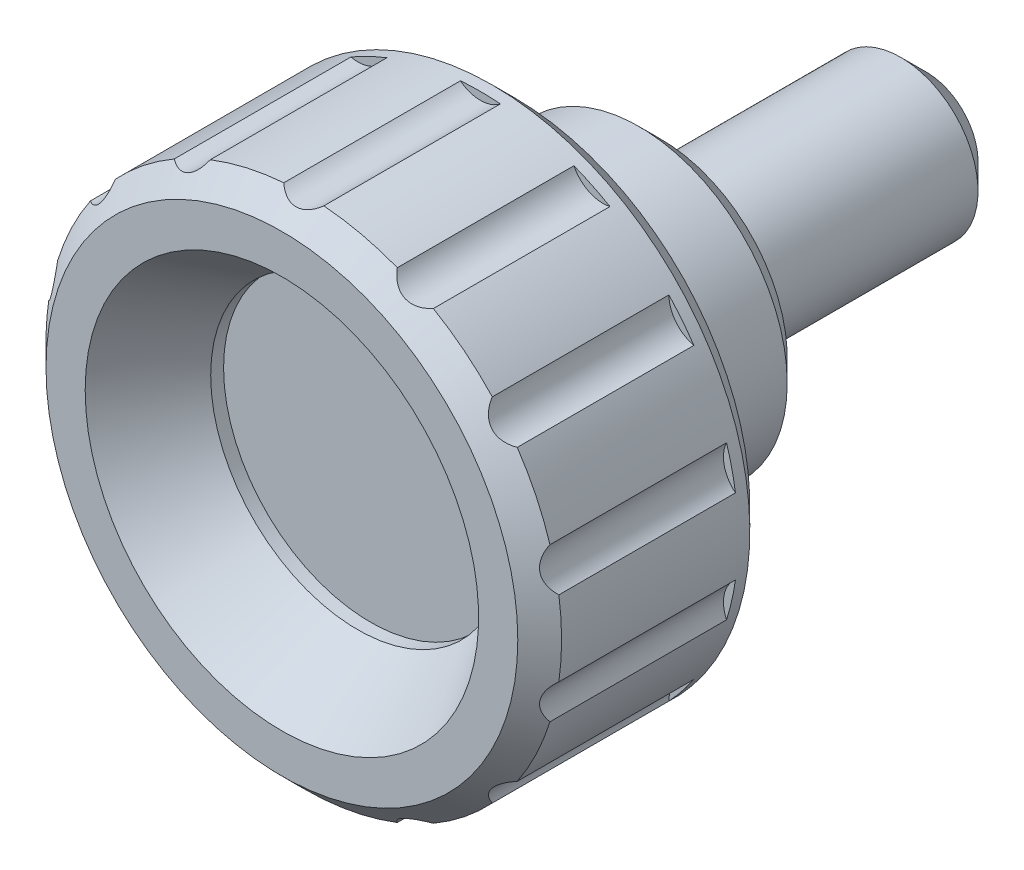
ISO-10303-21;
HEADER;
FILE_DESCRIPTION(('STEP AP214'),'2;1');
FILE_NAME('part.step','',(''),(''),'','','');
FILE_SCHEMA(('AUTOMOTIVE_DESIGN { 1 0 10303 214 1 1 1 1 }'));
ENDSEC;
DATA;
#1=APPLICATION_CONTEXT('core data for automotive mechanical design processes');
#2=APPLICATION_PROTOCOL_DEFINITION('international standard','automotive_design',2000,#1);
#3=PRODUCT_CONTEXT('',#1,'mechanical');
#4=PRODUCT('Part','Part','',(#3));
#5=PRODUCT_RELATED_PRODUCT_CATEGORY('part','',(#4));
#6=PRODUCT_DEFINITION_FORMATION('','',#4);
#7=PRODUCT_DEFINITION_CONTEXT('part definition',#1,'design');
#8=PRODUCT_DEFINITION('design','',#6,#7);
#9=PRODUCT_DEFINITION_SHAPE('','',#8);
#10=(LENGTH_UNIT() NAMED_UNIT(*) SI_UNIT(.MILLI.,.METRE.));
#11=(NAMED_UNIT(*) PLANE_ANGLE_UNIT() SI_UNIT($,.RADIAN.));
#12=(NAMED_UNIT(*) SI_UNIT($,.STERADIAN.) SOLID_ANGLE_UNIT());
#13=UNCERTAINTY_MEASURE_WITH_UNIT(LENGTH_MEASURE(1.E-05),#10,'distance_accuracy_value','');
#14=(GEOMETRIC_REPRESENTATION_CONTEXT(3) GLOBAL_UNCERTAINTY_ASSIGNED_CONTEXT((#13)) GLOBAL_UNIT_ASSIGNED_CONTEXT((#10,
#11,#12)) REPRESENTATION_CONTEXT('',''));
#15=CARTESIAN_POINT('',(0.,0.,0.));
#16=DIRECTION('',(0.,0.,1.));
#17=DIRECTION('',(1.,0.,0.));
#18=AXIS2_PLACEMENT_3D('',#15,#16,#17);
#19=CARTESIAN_POINT('',(0.,0.,0.));
#20=DIRECTION('',(0.,0.,-1.));
#21=DIRECTION('',(0.,1.,0.));
#22=AXIS2_PLACEMENT_3D('',#19,#20,#21);
#23=CYLINDRICAL_SURFACE('',#22,10.);
#24=CARTESIAN_POINT('',(0.,0.,14.15));
#25=DIRECTION('',(0.,0.,-1.));
#26=DIRECTION('',(-1.,0.,0.));
#27=AXIS2_PLACEMENT_3D('',#24,#25,#26);
#28=CIRCLE('',#27,10.);
#29=CARTESIAN_POINT('',(-8.27844244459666,-5.60958025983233,14.15));
#30=VERTEX_POINT('',#29);
#31=CARTESIAN_POINT('',(-9.54727089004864,-2.97483084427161,14.15));
#32=VERTEX_POINT('',#31);
#33=EDGE_CURVE('E226',#30,#32,#28,.T.);
#34=ORIENTED_EDGE('',*,*,#33,.T.);
#35=DIRECTION('',(0.,0.,1.));
#36=VECTOR('',#35,1.);
#37=CARTESIAN_POINT('',(-9.54727089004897,-2.97483084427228,7.3));
#38=LINE('',#37,#36);
#39=CARTESIAN_POINT('',(-9.54727089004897,-2.97483084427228,7.3));
#40=VERTEX_POINT('',#39);
#41=EDGE_CURVE('E234',#40,#32,#38,.T.);
#42=ORIENTED_EDGE('',*,*,#41,.F.);
#43=CARTESIAN_POINT('',(0.,0.,7.3));
#44=DIRECTION('',(0.,0.,1.));
#45=DIRECTION('',(0.,-1.,0.));
#46=AXIS2_PLACEMENT_3D('',#43,#44,#45);
#47=CIRCLE('',#46,10.);
#48=CARTESIAN_POINT('',(-9.89252457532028,-1.46217561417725,7.3));
#49=VERTEX_POINT('',#48);
#50=EDGE_CURVE('E407',#40,#49,#47,.F.);
#51=ORIENTED_EDGE('',*,*,#50,.T.);
#52=DIRECTION('',(0.,0.,1.));
#53=VECTOR('',#52,1.);
#54=CARTESIAN_POINT('',(-9.89252457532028,-1.46217561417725,7.3));
#55=LINE('',#54,#53);
#56=CARTESIAN_POINT('',(-9.89252457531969,-1.46217561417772,14.15));
#57=VERTEX_POINT('',#56);
#58=EDGE_CURVE('E225',#49,#57,#55,.T.);
#59=ORIENTED_EDGE('',*,*,#58,.T.);
#60=CARTESIAN_POINT('',(-9.8925245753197,1.46217561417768,14.15));
#61=VERTEX_POINT('',#60);
#62=EDGE_CURVE('E207',#57,#61,#28,.T.);
#63=ORIENTED_EDGE('',*,*,#62,.T.);
#64=DIRECTION('',(0.,0.,1.));
#65=VECTOR('',#64,1.);
#66=CARTESIAN_POINT('',(-9.89252457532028,1.46217561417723,7.3));
#67=LINE('',#66,#65);
#68=CARTESIAN_POINT('',(-9.89252457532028,1.46217561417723,7.3));
#69=VERTEX_POINT('',#68);
#70=EDGE_CURVE('E223',#69,#61,#67,.T.);
#71=ORIENTED_EDGE('',*,*,#70,.F.);
#72=CARTESIAN_POINT('',(-9.54727089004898,2.97483084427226,7.3));
#73=VERTEX_POINT('',#72);
#74=EDGE_CURVE('E621',#69,#73,#47,.F.);
#75=ORIENTED_EDGE('',*,*,#74,.T.);
#76=DIRECTION('',(0.,0.,1.));
#77=VECTOR('',#76,1.);
#78=CARTESIAN_POINT('',(-9.54727089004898,2.97483084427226,7.3));
#79=LINE('',#78,#77);
#80=CARTESIAN_POINT('',(-9.54727089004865,2.97483084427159,14.15));
#81=VERTEX_POINT('',#80);
#82=EDGE_CURVE('E232',#73,#81,#79,.T.);
#83=ORIENTED_EDGE('',*,*,#82,.T.);
#84=CARTESIAN_POINT('',(-8.27844244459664,5.60958025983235,14.15));
#85=VERTEX_POINT('',#84);
#86=EDGE_CURVE('E210',#81,#85,#28,.T.);
#87=ORIENTED_EDGE('',*,*,#86,.T.);
#88=DIRECTION('',(0.,0.,1.));
#89=VECTOR('',#88,1.);
#90=CARTESIAN_POINT('',(-8.27844244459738,5.60958025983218,7.3));
#91=LINE('',#90,#89);
#92=CARTESIAN_POINT('',(-8.27844244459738,5.60958025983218,7.3));
#93=VERTEX_POINT('',#92);
#94=EDGE_CURVE('E236',#93,#85,#91,.T.);
#95=ORIENTED_EDGE('',*,*,#94,.F.);
#96=CARTESIAN_POINT('',(-7.31106311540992,6.82263557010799,7.3));
#97=VERTEX_POINT('',#96);
#98=EDGE_CURVE('E622',#93,#97,#47,.F.);
#99=ORIENTED_EDGE('',*,*,#98,.T.);
#100=DIRECTION('',(0.,0.,1.));
#101=VECTOR('',#100,1.);
#102=CARTESIAN_POINT('',(-7.31106311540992,6.82263557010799,7.3));
#103=LINE('',#102,#101);
#104=CARTESIAN_POINT('',(-7.31106311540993,6.82263557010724,14.15));
#105=VERTEX_POINT('',#104);
#106=EDGE_CURVE('E242',#97,#105,#103,.T.);
#107=ORIENTED_EDGE('',*,*,#106,.T.);
#108=CARTESIAN_POINT('',(-5.02471325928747,8.64593873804,14.15));
#109=VERTEX_POINT('',#108);
#110=EDGE_CURVE('E591',#105,#109,#28,.T.);
#111=ORIENTED_EDGE('',*,*,#110,.T.);
#112=DIRECTION('',(0.,0.,1.));
#113=VECTOR('',#112,1.);
#114=CARTESIAN_POINT('',(-5.02471325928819,8.64593873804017,7.3));
#115=LINE('',#114,#113);
#116=CARTESIAN_POINT('',(-5.02471325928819,8.64593873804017,7.3));
#117=VERTEX_POINT('',#116);
#118=EDGE_CURVE('E245',#117,#109,#115,.T.);
#119=ORIENTED_EDGE('',*,*,#118,.F.);
#120=CARTESIAN_POINT('',(-3.62680962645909,9.3191336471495,7.3));
#121=VERTEX_POINT('',#120);
#122=EDGE_CURVE('E266',#117,#121,#47,.F.);
#123=ORIENTED_EDGE('',*,*,#122,.T.);
#124=DIRECTION('',(0.,0.,1.));
#125=VECTOR('',#124,1.);
#126=CARTESIAN_POINT('',(-3.62680962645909,9.3191336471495,7.3));
#127=LINE('',#126,#125);
#128=CARTESIAN_POINT('',(-3.62680962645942,9.31913364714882,14.15));
#129=VERTEX_POINT('',#128);
#130=EDGE_CURVE('E248',#121,#129,#127,.T.);
#131=ORIENTED_EDGE('',*,*,#130,.T.);
#132=CARTESIAN_POINT('',(-0.775777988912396,9.96986301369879,14.15));
#133=VERTEX_POINT('',#132);
#134=EDGE_CURVE('E585',#129,#133,#28,.T.);
#135=ORIENTED_EDGE('',*,*,#134,.T.);
#136=DIRECTION('',(0.,0.,1.));
#137=VECTOR('',#136,1.);
#138=CARTESIAN_POINT('',(-0.775777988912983,9.96986301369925,7.3));
#139=LINE('',#138,#137);
#140=CARTESIAN_POINT('',(-0.775777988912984,9.96986301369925,7.3));
#141=VERTEX_POINT('',#140);
#142=EDGE_CURVE('E251',#141,#133,#139,.T.);
#143=ORIENTED_EDGE('',*,*,#142,.F.);
#144=CARTESIAN_POINT('',(0.775777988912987,9.96986301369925,7.3));
#145=VERTEX_POINT('',#144);
#146=EDGE_CURVE('E41',#141,#145,#47,.F.);
#147=ORIENTED_EDGE('',*,*,#146,.T.);
#148=DIRECTION('',(0.,0.,1.));
#149=VECTOR('',#148,1.);
#150=CARTESIAN_POINT('',(0.775777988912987,9.96986301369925,7.3));
#151=LINE('',#150,#149);
#152=CARTESIAN_POINT('',(0.775777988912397,9.96986301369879,14.15));
#153=VERTEX_POINT('',#152);
#154=EDGE_CURVE('E254',#145,#153,#151,.T.);
#155=ORIENTED_EDGE('',*,*,#154,.T.);
#156=CARTESIAN_POINT('',(3.62680962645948,9.3191336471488,14.15));
#157=VERTEX_POINT('',#156);
#158=EDGE_CURVE('E588',#153,#157,#28,.T.);
#159=ORIENTED_EDGE('',*,*,#158,.T.);
#160=DIRECTION('',(0.,0.,1.));
#161=VECTOR('',#160,1.);
#162=CARTESIAN_POINT('',(3.62680962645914,9.31913364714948,7.3));
#163=LINE('',#162,#161);
#164=CARTESIAN_POINT('',(3.62680962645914,9.31913364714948,7.3));
#165=VERTEX_POINT('',#164);
#166=EDGE_CURVE('E262',#165,#157,#163,.T.);
#167=ORIENTED_EDGE('',*,*,#166,.F.);
#168=CARTESIAN_POINT('',(5.02471325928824,8.64593873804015,7.3));
#169=VERTEX_POINT('',#168);
#170=EDGE_CURVE('E267',#165,#169,#47,.F.);
#171=ORIENTED_EDGE('',*,*,#170,.T.);
#172=DIRECTION('',(0.,0.,1.));
#173=VECTOR('',#172,1.);
#174=CARTESIAN_POINT('',(5.02471325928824,8.64593873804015,7.3));
#175=LINE('',#174,#173);
#176=CARTESIAN_POINT('',(5.02471325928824,8.64593873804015,14.15));
#177=VERTEX_POINT('',#176);
#178=EDGE_CURVE('E352',#169,#177,#175,.T.);
#179=ORIENTED_EDGE('',*,*,#178,.T.);
#180=CARTESIAN_POINT('',(7.31106311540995,6.82263557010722,14.15));
#181=VERTEX_POINT('',#180);
#182=EDGE_CURVE('E34',#177,#181,#28,.T.);
#183=ORIENTED_EDGE('',*,*,#182,.T.);
#184=DIRECTION('',(0.,0.,1.));
#185=VECTOR('',#184,1.);
#186=CARTESIAN_POINT('',(7.31106311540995,6.82263557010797,7.3));
#187=LINE('',#186,#185);
#188=CARTESIAN_POINT('',(7.31106311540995,6.82263557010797,7.3));
#189=VERTEX_POINT('',#188);
#190=EDGE_CURVE('E355',#189,#181,#187,.T.);
#191=ORIENTED_EDGE('',*,*,#190,.F.);
#192=CARTESIAN_POINT('',(8.27844244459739,5.60958025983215,7.3));
#193=VERTEX_POINT('',#192);
#194=EDGE_CURVE('E598',#189,#193,#47,.F.);
#195=ORIENTED_EDGE('',*,*,#194,.T.);
#196=DIRECTION('',(0.,0.,1.));
#197=VECTOR('',#196,1.);
#198=CARTESIAN_POINT('',(8.27844244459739,5.60958025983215,7.3));
#199=LINE('',#198,#197);
#200=CARTESIAN_POINT('',(8.27844244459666,5.60958025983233,14.15));
#201=VERTEX_POINT('',#200);
#202=EDGE_CURVE('E358',#193,#201,#199,.T.);
#203=ORIENTED_EDGE('',*,*,#202,.T.);
#204=CARTESIAN_POINT('',(9.54727089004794,2.97483084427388,14.15));
#205=VERTEX_POINT('',#204);
#206=EDGE_CURVE('E686',#201,#205,#28,.T.);
#207=ORIENTED_EDGE('',*,*,#206,.T.);
#208=DIRECTION('',(0.,0.,1.));
#209=VECTOR('',#208,1.);
#210=CARTESIAN_POINT('',(9.54727089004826,2.97483084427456,7.3));
#211=LINE('',#210,#209);
#212=CARTESIAN_POINT('',(9.54727089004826,2.97483084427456,7.3));
#213=VERTEX_POINT('',#212);
#214=EDGE_CURVE('E361',#213,#205,#211,.T.);
#215=ORIENTED_EDGE('',*,*,#214,.F.);
#216=CARTESIAN_POINT('',(9.89252457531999,1.46217561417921,7.3));
#217=VERTEX_POINT('',#216);
#218=EDGE_CURVE('E600',#213,#217,#47,.F.);
#219=ORIENTED_EDGE('',*,*,#218,.T.);
#220=DIRECTION('',(0.,0.,1.));
#221=VECTOR('',#220,1.);
#222=CARTESIAN_POINT('',(9.89252457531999,1.46217561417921,7.3));
#223=LINE('',#222,#221);
#224=CARTESIAN_POINT('',(9.8925245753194,1.46217561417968,14.15));
#225=VERTEX_POINT('',#224);
#226=EDGE_CURVE('E364',#217,#225,#223,.T.);
#227=ORIENTED_EDGE('',*,*,#226,.T.);
#228=CARTESIAN_POINT('',(9.89252457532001,-1.46217561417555,14.15));
#229=VERTEX_POINT('',#228);
#230=EDGE_CURVE('E684',#225,#229,#28,.T.);
#231=ORIENTED_EDGE('',*,*,#230,.T.);
#232=DIRECTION('',(0.,0.,1.));
#233=VECTOR('',#232,1.);
#234=CARTESIAN_POINT('',(9.8925245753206,-1.46217561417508,7.3));
#235=LINE('',#234,#233);
#236=CARTESIAN_POINT('',(9.8925245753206,-1.46217561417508,7.3));
#237=VERTEX_POINT('',#236);
#238=EDGE_CURVE('E367',#237,#229,#235,.T.);
#239=ORIENTED_EDGE('',*,*,#238,.F.);
#240=CARTESIAN_POINT('',(9.54727089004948,-2.97483084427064,7.3));
#241=VERTEX_POINT('',#240);
#242=EDGE_CURVE('E603',#237,#241,#47,.F.);
#243=ORIENTED_EDGE('',*,*,#242,.T.);
#244=DIRECTION('',(0.,0.,1.));
#245=VECTOR('',#244,1.);
#246=CARTESIAN_POINT('',(9.54727089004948,-2.97483084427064,7.3));
#247=LINE('',#246,#245);
#248=CARTESIAN_POINT('',(9.54727089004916,-2.97483084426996,14.15));
#249=VERTEX_POINT('',#248);
#250=EDGE_CURVE('E370',#241,#249,#247,.T.);
#251=ORIENTED_EDGE('',*,*,#250,.T.);
#252=CARTESIAN_POINT('',(8.27844244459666,-5.60958025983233,14.15));
#253=VERTEX_POINT('',#252);
#254=EDGE_CURVE('E682',#249,#253,#28,.T.);
#255=ORIENTED_EDGE('',*,*,#254,.T.);
#256=DIRECTION('',(0.,0.,1.));
#257=VECTOR('',#256,1.);
#258=CARTESIAN_POINT('',(8.27844244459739,-5.60958025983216,7.3));
#259=LINE('',#258,#257);
#260=CARTESIAN_POINT('',(8.27844244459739,-5.60958025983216,7.3));
#261=VERTEX_POINT('',#260);
#262=EDGE_CURVE('E373',#261,#253,#259,.T.);
#263=ORIENTED_EDGE('',*,*,#262,.F.);
#264=CARTESIAN_POINT('',(7.31106311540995,-6.82263557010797,7.3));
#265=VERTEX_POINT('',#264);
#266=EDGE_CURVE('E606',#261,#265,#47,.F.);
#267=ORIENTED_EDGE('',*,*,#266,.T.);
#268=DIRECTION('',(0.,0.,1.));
#269=VECTOR('',#268,1.);
#270=CARTESIAN_POINT('',(7.31106311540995,-6.82263557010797,7.3));
#271=LINE('',#270,#269);
#272=CARTESIAN_POINT('',(7.31106311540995,-6.82263557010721,14.15));
#273=VERTEX_POINT('',#272);
#274=EDGE_CURVE('E376',#265,#273,#271,.T.);
#275=ORIENTED_EDGE('',*,*,#274,.T.);
#276=CARTESIAN_POINT('',(5.02471325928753,-8.64593873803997,14.15));
#277=VERTEX_POINT('',#276);
#278=EDGE_CURVE('E680',#273,#277,#28,.T.);
#279=ORIENTED_EDGE('',*,*,#278,.T.);
#280=DIRECTION('',(0.,0.,1.));
#281=VECTOR('',#280,1.);
#282=CARTESIAN_POINT('',(5.02471325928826,-8.64593873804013,7.3));
#283=LINE('',#282,#281);
#284=CARTESIAN_POINT('',(5.02471325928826,-8.64593873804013,7.3));
#285=VERTEX_POINT('',#284);
#286=EDGE_CURVE('E379',#285,#277,#283,.T.);
#287=ORIENTED_EDGE('',*,*,#286,.F.);
#288=CARTESIAN_POINT('',(3.62680962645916,-9.31913364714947,7.3));
#289=VERTEX_POINT('',#288);
#290=EDGE_CURVE('E609',#285,#289,#47,.F.);
#291=ORIENTED_EDGE('',*,*,#290,.T.);
#292=DIRECTION('',(0.,0.,1.));
#293=VECTOR('',#292,1.);
#294=CARTESIAN_POINT('',(3.62680962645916,-9.31913364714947,7.3));
#295=LINE('',#294,#293);
#296=CARTESIAN_POINT('',(3.62680962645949,-9.31913364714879,14.15));
#297=VERTEX_POINT('',#296);
#298=EDGE_CURVE('E382',#289,#297,#295,.T.);
#299=ORIENTED_EDGE('',*,*,#298,.T.);
#300=CARTESIAN_POINT('',(0.775777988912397,-9.96986301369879,14.15));
#301=VERTEX_POINT('',#300);
#302=EDGE_CURVE('E678',#297,#301,#28,.T.);
#303=ORIENTED_EDGE('',*,*,#302,.T.);
#304=DIRECTION('',(0.,0.,1.));
#305=VECTOR('',#304,1.);
#306=CARTESIAN_POINT('',(0.775777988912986,-9.96986301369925,7.3));
#307=LINE('',#306,#305);
#308=CARTESIAN_POINT('',(0.775777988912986,-9.96986301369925,7.3));
#309=VERTEX_POINT('',#308);
#310=EDGE_CURVE('E385',#309,#301,#307,.T.);
#311=ORIENTED_EDGE('',*,*,#310,.F.);
#312=CARTESIAN_POINT('',(-0.775777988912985,-9.96986301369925,7.3));
#313=VERTEX_POINT('',#312);
#314=EDGE_CURVE('E612',#309,#313,#47,.F.);
#315=ORIENTED_EDGE('',*,*,#314,.T.);
#316=DIRECTION('',(0.,0.,1.));
#317=VECTOR('',#316,1.);
#318=CARTESIAN_POINT('',(-0.775777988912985,-9.96986301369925,7.3));
#319=LINE('',#318,#317);
#320=CARTESIAN_POINT('',(-0.775777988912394,-9.96986301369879,14.15));
#321=VERTEX_POINT('',#320);
#322=EDGE_CURVE('E388',#313,#321,#319,.T.);
#323=ORIENTED_EDGE('',*,*,#322,.T.);
#324=CARTESIAN_POINT('',(-3.62680962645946,-9.3191336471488,14.15));
#325=VERTEX_POINT('',#324);
#326=EDGE_CURVE('E412',#321,#325,#28,.T.);
#327=ORIENTED_EDGE('',*,*,#326,.T.);
#328=DIRECTION('',(0.,0.,1.));
#329=VECTOR('',#328,1.);
#330=CARTESIAN_POINT('',(-3.62680962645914,-9.31913364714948,7.3));
#331=LINE('',#330,#329);
#332=CARTESIAN_POINT('',(-3.62680962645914,-9.31913364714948,7.3));
#333=VERTEX_POINT('',#332);
#334=EDGE_CURVE('E391',#333,#325,#331,.T.);
#335=ORIENTED_EDGE('',*,*,#334,.F.);
#336=CARTESIAN_POINT('',(-5.02471325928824,-8.64593873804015,7.3));
#337=VERTEX_POINT('',#336);
#338=EDGE_CURVE('E615',#333,#337,#47,.F.);
#339=ORIENTED_EDGE('',*,*,#338,.T.);
#340=DIRECTION('',(0.,0.,1.));
#341=VECTOR('',#340,1.);
#342=CARTESIAN_POINT('',(-5.02471325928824,-8.64593873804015,7.3));
#343=LINE('',#342,#341);
#344=CARTESIAN_POINT('',(-5.02471325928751,-8.64593873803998,14.15));
#345=VERTEX_POINT('',#344);
#346=EDGE_CURVE('E394',#337,#345,#343,.T.);
#347=ORIENTED_EDGE('',*,*,#346,.T.);
#348=CARTESIAN_POINT('',(-7.31106311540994,-6.82263557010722,14.15));
#349=VERTEX_POINT('',#348);
#350=EDGE_CURVE('E410',#345,#349,#28,.T.);
#351=ORIENTED_EDGE('',*,*,#350,.T.);
#352=DIRECTION('',(0.,0.,1.));
#353=VECTOR('',#352,1.);
#354=CARTESIAN_POINT('',(-7.31106311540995,-6.82263557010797,7.3));
#355=LINE('',#354,#353);
#356=CARTESIAN_POINT('',(-7.31106311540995,-6.82263557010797,7.3));
#357=VERTEX_POINT('',#356);
#358=EDGE_CURVE('E397',#357,#349,#355,.T.);
#359=ORIENTED_EDGE('',*,*,#358,.F.);
#360=CARTESIAN_POINT('',(-8.27844244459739,-5.60958025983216,7.3));
#361=VERTEX_POINT('',#360);
#362=EDGE_CURVE('E618',#357,#361,#47,.F.);
#363=ORIENTED_EDGE('',*,*,#362,.T.);
#364=DIRECTION('',(0.,0.,1.));
#365=VECTOR('',#364,1.);
#366=CARTESIAN_POINT('',(-8.27844244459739,-5.60958025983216,7.3));
#367=LINE('',#366,#365);
#368=EDGE_CURVE('E400',#361,#30,#367,.T.);
#369=ORIENTED_EDGE('',*,*,#368,.T.);
#370=EDGE_LOOP('',(#34,#42,#51,#59,#63,#71,#75,#83,#87,#95,#99,#107,#111,#119,#123,#131,#135,
#143,#147,#155,#159,#167,#171,#179,#183,#191,#195,#203,#207,#215,#219,#227,#231,#239,#243,#251,
#255,#263,#267,#275,#279,#287,#291,#299,#303,#311,#315,#323,#327,#335,#339,#347,#351,#359,#363,#369));
#371=FACE_BOUND('',#370,.T.);
#372=CARTESIAN_POINT('',(0.,0.,6.85));
#373=DIRECTION('',(0.,0.,-1.));
#374=DIRECTION('',(0.,1.,0.));
#375=AXIS2_PLACEMENT_3D('',#372,#373,#374);
#376=CIRCLE('',#375,10.);
#377=CARTESIAN_POINT('',(0.,10.,6.85));
#378=VERTEX_POINT('',#377);
#379=EDGE_CURVE('E258',#378,#378,#376,.T.);
#380=ORIENTED_EDGE('',*,*,#379,.F.);
#381=EDGE_LOOP('',(#380));
#382=FACE_BOUND('',#381,.T.);
#383=ADVANCED_FACE('F14',(#371,#382),#23,.T.);
#384=CARTESIAN_POINT('',(9.15,0.,6.));
#385=DIRECTION('',(0.,0.,-1.));
#386=DIRECTION('',(0.,1.,0.));
#387=AXIS2_PLACEMENT_3D('',#384,#385,#386);
#388=PLANE('',#387);
#389=CARTESIAN_POINT('',(0.,0.,6.));
#390=DIRECTION('',(0.,0.,-1.));
#391=DIRECTION('',(0.,1.,0.));
#392=AXIS2_PLACEMENT_3D('',#389,#390,#391);
#393=CIRCLE('',#392,9.15);
#394=CARTESIAN_POINT('',(0.,9.15,6.));
#395=VERTEX_POINT('',#394);
#396=EDGE_CURVE('E261',#395,#395,#393,.T.);
#397=ORIENTED_EDGE('',*,*,#396,.T.);
#398=EDGE_LOOP('',(#397));
#399=FACE_BOUND('',#398,.T.);
#400=CARTESIAN_POINT('',(0.,0.,6.));
#401=DIRECTION('',(0.,0.,-1.));
#402=DIRECTION('',(-1.,0.,0.));
#403=AXIS2_PLACEMENT_3D('',#400,#401,#402);
#404=CIRCLE('',#403,5.75);
#405=CARTESIAN_POINT('',(-5.75,0.,6.));
#406=VERTEX_POINT('',#405);
#407=EDGE_CURVE('E303',#406,#406,#404,.T.);
#408=ORIENTED_EDGE('',*,*,#407,.F.);
#409=EDGE_LOOP('',(#408));
#410=FACE_BOUND('',#409,.T.);
#411=ADVANCED_FACE('F556',(#399,#410),#388,.T.);
#412=CARTESIAN_POINT('',(0.,0.,6.));
#413=DIRECTION('',(0.,0.,1.));
#414=DIRECTION('',(0.,-1.,0.));
#415=AXIS2_PLACEMENT_3D('',#412,#413,#414);
#416=CONICAL_SURFACE('',#415,9.15,0.785398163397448);
#417=ORIENTED_EDGE('',*,*,#379,.T.);
#418=EDGE_LOOP('',(#417));
#419=FACE_BOUND('',#418,.T.);
#420=ORIENTED_EDGE('',*,*,#396,.F.);
#421=EDGE_LOOP('',(#420));
#422=FACE_BOUND('',#421,.T.);
#423=ADVANCED_FACE('F544',(#419,#422),#416,.T.);
#424=CARTESIAN_POINT('',(0.,10.9500000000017,7.3));
#425=DIRECTION('',(0.,0.,1.));
#426=DIRECTION('',(0.,-1.,0.));
#427=AXIS2_PLACEMENT_3D('',#424,#425,#426);
#428=CYLINDRICAL_SURFACE('',#427,1.25);
#429=CARTESIAN_POINT('',(0.775977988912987,9.97002134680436,14.1498266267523));
#430=CARTESIAN_POINT('',(0.734586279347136,9.93724261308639,14.1857107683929));
#431=CARTESIAN_POINT('',(0.68995529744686,9.90618033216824,14.2199249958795));
#432=CARTESIAN_POINT('',(0.593942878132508,9.84868428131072,14.2835331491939));
#433=CARTESIAN_POINT('',(0.542499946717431,9.82229852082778,14.3128768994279));
#434=CARTESIAN_POINT('',(0.443151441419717,9.78017982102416,14.3598826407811));
#435=CARTESIAN_POINT('',(0.396256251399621,9.76338583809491,14.3786950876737));
#436=CARTESIAN_POINT('',(0.299067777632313,9.73525526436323,14.4102700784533));
#437=CARTESIAN_POINT('',(0.248787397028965,9.7238991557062,14.4230542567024));
#438=CARTESIAN_POINT('',(0.145474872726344,9.70738511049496,14.4416620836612));
#439=CARTESIAN_POINT('',(0.0924231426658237,9.70228010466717,14.4474262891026));
#440=CARTESIAN_POINT('',(-0.0142000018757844,9.69894396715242,14.4511919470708));
#441=CARTESIAN_POINT('',(-0.0677715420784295,9.70071454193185,14.4491914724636));
#442=CARTESIAN_POINT('',(-0.167200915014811,9.71034496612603,14.4383278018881));
#443=CARTESIAN_POINT('',(-0.213227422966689,9.71746747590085,14.4302956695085));
#444=CARTESIAN_POINT('',(-0.30302476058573,9.7364164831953,14.4089716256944));
#445=CARTESIAN_POINT('',(-0.346794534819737,9.74824515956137,14.3956772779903));
#446=CARTESIAN_POINT('',(-0.445997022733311,9.78073865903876,14.3592589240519));
#447=CARTESIAN_POINT('',(-0.500224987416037,9.80304471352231,14.3343253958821));
#448=CARTESIAN_POINT('',(-0.602533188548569,9.8533143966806,14.2784064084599));
#449=CARTESIAN_POINT('',(-0.650605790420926,9.88128494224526,14.2474135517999));
#450=CARTESIAN_POINT('',(-0.723578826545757,9.93016500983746,14.1935419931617));
#451=CARTESIAN_POINT('',(-0.750378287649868,9.94975642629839,14.1720143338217));
#452=CARTESIAN_POINT('',(-0.775977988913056,9.97002134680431,14.1498266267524));
#453=B_SPLINE_CURVE_WITH_KNOTS('',3,(#429,#430,#431,#432,#433,#434,#435,#436,#437,#438,#439,
#440,#441,#442,#443,#444,#445,#446,#447,#448,#449,#450,#451,#452),.UNSPECIFIED.,.F.,.F.,(4,2,2,
2,2,2,2,2,2,2,2,4),(0.,0.191836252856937,0.385540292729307,0.544632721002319,0.703149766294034,
0.86299996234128,1.022889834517,1.16405643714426,1.3052884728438,1.49538818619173,
1.68572144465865,1.80423553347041),.UNSPECIFIED.);
#454=EDGE_CURVE('E526',#153,#133,#453,.T.);
#455=ORIENTED_EDGE('',*,*,#454,.F.);
#456=ORIENTED_EDGE('',*,*,#154,.F.);
#457=CARTESIAN_POINT('',(0.,10.9500000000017,7.3));
#458=DIRECTION('',(0.,0.,-1.));
#459=DIRECTION('',(0.,-1.,0.));
#460=AXIS2_PLACEMENT_3D('',#457,#458,#459);
#461=CIRCLE('',#460,1.25);
#462=EDGE_CURVE('E305',#145,#141,#461,.T.);
#463=ORIENTED_EDGE('',*,*,#462,.T.);
#464=ORIENTED_EDGE('',*,*,#142,.T.);
#465=EDGE_LOOP('',(#455,#456,#463,#464));
#466=FACE_BOUND('',#465,.T.);
#467=ADVANCED_FACE('F540',(#466),#428,.F.);
#468=CARTESIAN_POINT('',(0.,0.,7.3));
#469=DIRECTION('',(0.,0.,1.));
#470=DIRECTION('',(0.,-1.,0.));
#471=AXIS2_PLACEMENT_3D('',#468,#469,#470);
#472=PLANE('',#471);
#473=ORIENTED_EDGE('',*,*,#462,.F.);
#474=ORIENTED_EDGE('',*,*,#146,.F.);
#475=EDGE_LOOP('',(#473,#474));
#476=FACE_BOUND('',#475,.T.);
#477=ADVANCED_FACE('F536',(#476),#472,.T.);
#478=CARTESIAN_POINT('',(-4.75102694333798,9.86560910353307,7.3));
#479=DIRECTION('',(0.,0.,1.));
#480=DIRECTION('',(0.,-1.,0.));
#481=AXIS2_PLACEMENT_3D('',#478,#479,#480);
#482=CYLINDRICAL_SURFACE('',#481,1.25);
#483=CARTESIAN_POINT('',(-3.62668101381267,9.31939831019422,14.1498));
#484=CARTESIAN_POINT('',(-3.64975063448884,9.27190450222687,14.185686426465));
#485=CARTESIAN_POINT('',(-3.67648365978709,9.22455160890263,14.2199029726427));
#486=CARTESIAN_POINT('',(-3.73804039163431,9.13108688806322,14.2835157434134));
#487=CARTESIAN_POINT('',(-3.77294034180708,9.08499163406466,14.3128617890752));
#488=CARTESIAN_POINT('',(-3.84417515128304,9.00393496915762,14.3598710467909));
#489=CARTESIAN_POINT('',(-3.87913908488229,8.96845594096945,14.3786848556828));
#490=CARTESIAN_POINT('',(-3.95449665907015,8.90094031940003,14.4102625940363));
#491=CARTESIAN_POINT('',(-3.99487020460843,8.86889173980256,14.4230481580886));
#492=CARTESIAN_POINT('',(-4.08078621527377,8.80918487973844,14.4416586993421));
#493=CARTESIAN_POINT('',(-4.12636930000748,8.78156579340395,14.447424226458));
#494=CARTESIAN_POINT('',(-4.2209865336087,8.73229533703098,14.4511922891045));
#495=CARTESIAN_POINT('',(-4.27002153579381,8.71064544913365,14.4491928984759));
#496=CARTESIAN_POINT('',(-4.36378339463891,8.67617932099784,14.4383310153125));
#497=CARTESIAN_POINT('',(-4.4083422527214,8.66262548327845,14.4302997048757));
#498=CARTESIAN_POINT('',(-4.49746880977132,8.64073471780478,14.408977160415));
#499=CARTESIAN_POINT('',(-4.54203650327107,8.63240020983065,14.3956834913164));
#500=CARTESIAN_POINT('',(-4.64551253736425,8.61863194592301,14.35926702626));
#501=CARTESIAN_POINT('',(-4.70404762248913,8.61519944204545,14.3343348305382));
#502=CARTESIAN_POINT('',(-4.81803389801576,8.6160989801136,14.2784184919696));
#503=CARTESIAN_POINT('',(-4.87348120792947,8.62044057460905,14.2474269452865));
#504=CARTESIAN_POINT('',(-4.96045702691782,8.63281949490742,14.1935439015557));
#505=CARTESIAN_POINT('',(-4.99312357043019,8.63884697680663,14.1720023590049));
#506=CARTESIAN_POINT('',(-5.02500036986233,8.6460031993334,14.1498));
#507=B_SPLINE_CURVE_WITH_KNOTS('',3,(#483,#484,#485,#486,#487,#488,#489,#490,#491,#492,#493,
#494,#495,#496,#497,#498,#499,#500,#501,#502,#503,#504,#505,#506),.UNSPECIFIED.,.F.,.F.,(4,2,2,
2,2,2,2,2,2,2,2,4),(0.,0.191843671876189,0.385555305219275,0.544650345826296,0.70316998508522,
0.863022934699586,1.02291553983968,1.16408261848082,1.305315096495,1.49541104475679,
1.68574073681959,1.80433015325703),.UNSPECIFIED.);
#508=EDGE_CURVE('E520',#129,#109,#507,.T.);
#509=ORIENTED_EDGE('',*,*,#508,.F.);
#510=ORIENTED_EDGE('',*,*,#130,.F.);
#511=CARTESIAN_POINT('',(-4.75102694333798,9.86560910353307,7.3));
#512=DIRECTION('',(0.,0.,-1.));
#513=DIRECTION('',(0.,-1.,0.));
#514=AXIS2_PLACEMENT_3D('',#511,#512,#513);
#515=CIRCLE('',#514,1.25);
#516=EDGE_CURVE('E308',#121,#117,#515,.T.);
#517=ORIENTED_EDGE('',*,*,#516,.T.);
#518=ORIENTED_EDGE('',*,*,#118,.T.);
#519=EDGE_LOOP('',(#509,#510,#517,#518));
#520=FACE_BOUND('',#519,.T.);
#521=ADVANCED_FACE('F532',(#520),#482,.F.);
#522=ORIENTED_EDGE('',*,*,#516,.F.);
#523=ORIENTED_EDGE('',*,*,#122,.F.);
#524=EDGE_LOOP('',(#522,#523));
#525=FACE_BOUND('',#524,.T.);
#526=ADVANCED_FACE('F535',(#525),#472,.T.);
#527=CARTESIAN_POINT('',(-8.56105473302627,6.82721333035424,7.3));
#528=DIRECTION('',(0.,0.,1.));
#529=DIRECTION('',(0.,-1.,0.));
#530=AXIS2_PLACEMENT_3D('',#527,#528,#529);
#531=CYLINDRICAL_SURFACE('',#530,1.25);
#532=CARTESIAN_POINT('',(-7.31106207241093,6.82292982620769,14.1498));
#533=CARTESIAN_POINT('',(-7.31124029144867,6.77012985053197,14.185686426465));
#534=CARTESIAN_POINT('',(-7.31478026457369,6.7158673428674,14.2199029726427));
#535=CARTESIAN_POINT('',(-7.32968814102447,6.60495007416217,14.2835157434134));
#536=CARTESIAN_POINT('',(-7.34113192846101,6.54827716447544,14.3128617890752));
#537=CARTESIAN_POINT('',(-7.37014310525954,6.44434000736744,14.3598710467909));
#538=CARTESIAN_POINT('',(-7.38625074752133,6.39720422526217,14.3786848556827));
#539=CARTESIAN_POINT('',(-7.42485164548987,6.30367832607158,14.4102625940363));
#540=CARTESIAN_POINT('',(-7.44732159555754,6.25728612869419,14.4230481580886));
#541=CARTESIAN_POINT('',(-7.4988234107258,6.16621454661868,14.4416586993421));
#542=CARTESIAN_POINT('',(-7.52790887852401,6.1215528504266,14.447424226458));
#543=CARTESIAN_POINT('',(-7.59177841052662,6.03610882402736,14.4511922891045));
#544=CARTESIAN_POINT('',(-7.62656388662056,5.99532745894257,14.449192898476));
#545=CARTESIAN_POINT('',(-7.69608610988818,5.92359280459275,14.4383310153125));
#546=CARTESIAN_POINT('',(-7.73035146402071,5.89204785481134,14.4302997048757));
#547=CARTESIAN_POINT('',(-7.80115367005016,5.83365439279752,14.408977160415));
#548=CARTESIAN_POINT('',(-7.83769156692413,5.80680806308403,14.3956834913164));
#549=CARTESIAN_POINT('',(-7.92494642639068,5.74950671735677,14.35926702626));
#550=CARTESIAN_POINT('',(-7.97619540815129,5.72101671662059,14.3343348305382));
#551=CARTESIAN_POINT('',(-8.07928378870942,5.67237038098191,14.2784184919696));
#552=CARTESIAN_POINT('',(-8.13112383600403,5.65222433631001,14.2474269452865));
#553=CARTESIAN_POINT('',(-8.21485735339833,5.62563996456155,14.1935439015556));
#554=CARTESIAN_POINT('',(-8.24690411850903,5.61689705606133,14.1720023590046));
#555=CARTESIAN_POINT('',(-8.27872909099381,5.60951376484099,14.1497999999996));
#556=B_SPLINE_CURVE_WITH_KNOTS('',3,(#532,#533,#534,#535,#536,#537,#538,#539,#540,#541,#542,
#543,#544,#545,#546,#547,#548,#549,#550,#551,#552,#553,#554,#555),.UNSPECIFIED.,.F.,.F.,(4,2,2,
2,2,2,2,2,2,2,2,4),(0.,0.191843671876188,0.385555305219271,0.544650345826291,0.703169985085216,
0.863022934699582,1.02291553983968,1.16408261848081,1.30531509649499,1.49541104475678,
1.68574073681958,1.80433015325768),.UNSPECIFIED.);
#557=EDGE_CURVE('E214',#105,#85,#556,.T.);
#558=ORIENTED_EDGE('',*,*,#557,.F.);
#559=ORIENTED_EDGE('',*,*,#106,.F.);
#560=CARTESIAN_POINT('',(-8.56105473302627,6.82721333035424,7.3));
#561=DIRECTION('',(0.,0.,-1.));
#562=DIRECTION('',(0.,-1.,0.));
#563=AXIS2_PLACEMENT_3D('',#560,#561,#562);
#564=CIRCLE('',#563,1.25);
#565=EDGE_CURVE('E317',#97,#93,#564,.T.);
#566=ORIENTED_EDGE('',*,*,#565,.T.);
#567=ORIENTED_EDGE('',*,*,#94,.T.);
#568=EDGE_LOOP('',(#558,#559,#566,#567));
#569=FACE_BOUND('',#568,.T.);
#570=ADVANCED_FACE('F538',(#569),#531,.F.);
#571=ORIENTED_EDGE('',*,*,#565,.F.);
#572=ORIENTED_EDGE('',*,*,#98,.F.);
#573=EDGE_LOOP('',(#571,#572));
#574=FACE_BOUND('',#573,.T.);
#575=ADVANCED_FACE('F633',(#574),#472,.T.);
#576=CARTESIAN_POINT('',(-10.6754606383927,2.43660422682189,7.3));
#577=DIRECTION('',(0.,0.,1.));
#578=DIRECTION('',(0.,-1.,0.));
#579=AXIS2_PLACEMENT_3D('',#576,#577,#578);
#580=CYLINDRICAL_SURFACE('',#579,1.25);
#581=CARTESIAN_POINT('',(-9.54736632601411,2.97503084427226,14.1498493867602));
#582=CARTESIAN_POINT('',(-9.52462174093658,2.9273834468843,14.1857315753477));
#583=CARTESIAN_POINT('',(-9.50427134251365,2.87696010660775,14.2199438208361));
#584=CARTESIAN_POINT('',(-9.46958497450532,2.77056257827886,14.2835480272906));
#585=CARTESIAN_POINT('',(-9.45530948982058,2.71453912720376,14.3128898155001));
#586=CARTESIAN_POINT('',(-9.43635639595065,2.60831065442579,14.3598925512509));
#587=CARTESIAN_POINT('',(-9.43041966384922,2.55885444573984,14.3787038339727));
#588=CARTESIAN_POINT('',(-9.42462285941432,2.45784375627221,14.4102764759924));
#589=CARTESIAN_POINT('',(-9.42474088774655,2.40629751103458,14.4230594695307));
#590=CARTESIAN_POINT('',(-9.43163191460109,2.30190179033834,14.4416649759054));
#591=CARTESIAN_POINT('',(-9.43846086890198,2.24904500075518,14.4474280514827));
#592=CARTESIAN_POINT('',(-9.45893571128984,2.14435457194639,14.4511916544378));
#593=CARTESIAN_POINT('',(-9.47258329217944,2.09252119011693,14.4491902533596));
#594=CARTESIAN_POINT('',(-9.50409843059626,1.99772918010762,14.4383250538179));
#595=CARTESIAN_POINT('',(-9.52128475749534,1.95444204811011,14.4302922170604));
#596=CARTESIAN_POINT('',(-9.55974139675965,1.8711137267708,14.4089668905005));
#597=CARTESIAN_POINT('',(-9.58101359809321,1.83107405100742,14.3956719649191));
#598=CARTESIAN_POINT('',(-9.63476844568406,1.7415896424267,14.3592520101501));
#599=CARTESIAN_POINT('',(-9.66858315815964,1.69368480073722,14.3343173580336));
#600=CARTESIAN_POINT('',(-9.74036028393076,1.60512785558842,14.2783961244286));
#601=CARTESIAN_POINT('',(-9.77832774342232,1.56448473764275,14.2474021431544));
#602=CARTESIAN_POINT('',(-9.84222639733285,1.50421436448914,14.1935250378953));
#603=CARTESIAN_POINT('',(-9.86729531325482,1.48244282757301,14.1719926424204));
#604=CARTESIAN_POINT('',(-9.89275398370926,1.46199133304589,14.1497999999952));
#605=B_SPLINE_CURVE_WITH_KNOTS('',3,(#581,#582,#583,#584,#585,#586,#587,#588,#589,#590,#591,
#592,#593,#594,#595,#596,#597,#598,#599,#600,#601,#602,#603,#604),.UNSPECIFIED.,.F.,.F.,(4,2,2,
2,2,2,2,2,2,2,2,4),(0.,0.191829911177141,0.385527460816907,0.54461765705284,0.703132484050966,
0.862980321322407,1.02286786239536,1.16403407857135,1.30526571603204,1.49536852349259,
1.68570495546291,1.80424243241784),.UNSPECIFIED.);
#606=EDGE_CURVE('E203',#81,#61,#605,.T.);
#607=ORIENTED_EDGE('',*,*,#606,.F.);
#608=ORIENTED_EDGE('',*,*,#82,.F.);
#609=CARTESIAN_POINT('',(-10.6754606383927,2.43660422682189,7.3));
#610=DIRECTION('',(0.,0.,-1.));
#611=DIRECTION('',(0.,-1.,0.));
#612=AXIS2_PLACEMENT_3D('',#609,#610,#611);
#613=CIRCLE('',#612,1.25);
#614=EDGE_CURVE('E231',#73,#69,#613,.T.);
#615=ORIENTED_EDGE('',*,*,#614,.T.);
#616=ORIENTED_EDGE('',*,*,#70,.T.);
#617=EDGE_LOOP('',(#607,#608,#615,#616));
#618=FACE_BOUND('',#617,.T.);
#619=ADVANCED_FACE('F229',(#618),#580,.F.);
#620=ORIENTED_EDGE('',*,*,#614,.F.);
#621=ORIENTED_EDGE('',*,*,#74,.F.);
#622=EDGE_LOOP('',(#620,#621));
#623=FACE_BOUND('',#622,.T.);
#624=ADVANCED_FACE('F635',(#623),#472,.T.);
#625=CARTESIAN_POINT('',(-10.6754606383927,-2.43660422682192,7.3));
#626=DIRECTION('',(0.,0.,1.));
#627=DIRECTION('',(0.,-1.,0.));
#628=AXIS2_PLACEMENT_3D('',#625,#626,#627);
#629=CYLINDRICAL_SURFACE('',#628,1.25);
#630=CARTESIAN_POINT('',(-9.89275398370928,-1.46199133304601,14.1497999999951));
#631=CARTESIAN_POINT('',(-9.85158441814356,-1.49505091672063,14.185686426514));
#632=CARTESIAN_POINT('',(-9.81136741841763,-1.53165069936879,14.2199029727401));
#633=CARTESIAN_POINT('',(-9.73394371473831,-1.61246193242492,14.283515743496));
#634=CARTESIAN_POINT('',(-9.69677013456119,-1.65674402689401,14.3128617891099));
#635=CARTESIAN_POINT('',(-9.63359696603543,-1.74422963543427,14.3598710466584));
#636=CARTESIAN_POINT('',(-9.60678767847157,-1.78621177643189,14.3786848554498));
#637=CARTESIAN_POINT('',(-9.55773345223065,-1.87470361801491,14.4102625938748));
#638=CARTESIAN_POINT('',(-9.53547235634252,-1.92119639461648,14.4230481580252));
#639=CARTESIAN_POINT('',(-9.49638058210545,-2.01824433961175,14.4416586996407));
#640=CARTESIAN_POINT('',(-9.47959715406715,-2.06883038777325,14.4474242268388));
#641=CARTESIAN_POINT('',(-9.45261632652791,-2.17203907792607,14.4511922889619));
#642=CARTESIAN_POINT('',(-9.44242056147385,-2.22466222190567,14.4491928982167));
#643=CARTESIAN_POINT('',(-9.42968254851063,-2.32374270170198,14.438331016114));
#644=CARTESIAN_POINT('',(-9.42638381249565,-2.37020038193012,14.4302997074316));
#645=CARTESIAN_POINT('',(-9.42487441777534,-2.46196350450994,14.4089771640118));
#646=CARTESIAN_POINT('',(-9.42666611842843,-2.50726840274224,14.3956834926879));
#647=CARTESIAN_POINT('',(-9.43626864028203,-2.61121384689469,14.3592670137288));
#648=CARTESIAN_POINT('',(-9.44594748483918,-2.66904517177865,14.3343348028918));
#649=CARTESIAN_POINT('',(-9.47218881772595,-2.77997341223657,14.2784184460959));
#650=CARTESIAN_POINT('',(-9.48875974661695,-2.83306442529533,14.2474269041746));
#651=CARTESIAN_POINT('',(-9.52017328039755,-2.9150816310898,14.1935592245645));
#652=CARTESIAN_POINT('',(-9.53330808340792,-2.94556603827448,14.1720342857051));
#653=CARTESIAN_POINT('',(-9.54736632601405,-2.97503084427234,14.1498493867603));
#654=B_SPLINE_CURVE_WITH_KNOTS('',3,(#630,#631,#632,#633,#634,#635,#636,#637,#638,#639,#640,
#641,#642,#643,#644,#645,#646,#647,#648,#649,#650,#651,#652,#653),.UNSPECIFIED.,.F.,.F.,(4,2,2,
2,2,2,2,2,2,2,2,4),(0.,0.191843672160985,0.385555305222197,0.544650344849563,0.703169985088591,
0.863022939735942,1.02291553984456,1.16408259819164,1.30531509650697,1.49541116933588,
1.68574073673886,1.80424237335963),.UNSPECIFIED.);
#655=EDGE_CURVE('E215',#57,#32,#654,.T.);
#656=ORIENTED_EDGE('',*,*,#655,.F.);
#657=ORIENTED_EDGE('',*,*,#58,.F.);
#658=CARTESIAN_POINT('',(-10.6754606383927,-2.43660422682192,7.3));
#659=DIRECTION('',(0.,0.,-1.));
#660=DIRECTION('',(0.,-1.,0.));
#661=AXIS2_PLACEMENT_3D('',#658,#659,#660);
#662=CIRCLE('',#661,1.25);
#663=EDGE_CURVE('E321',#49,#40,#662,.T.);
#664=ORIENTED_EDGE('',*,*,#663,.T.);
#665=ORIENTED_EDGE('',*,*,#41,.T.);
#666=EDGE_LOOP('',(#656,#657,#664,#665));
#667=FACE_BOUND('',#666,.T.);
#668=ADVANCED_FACE('F405',(#667),#629,.F.);
#669=ORIENTED_EDGE('',*,*,#663,.F.);
#670=ORIENTED_EDGE('',*,*,#50,.F.);
#671=EDGE_LOOP('',(#669,#670));
#672=FACE_BOUND('',#671,.T.);
#673=ADVANCED_FACE('F644',(#672),#472,.T.);
#674=CARTESIAN_POINT('',(-8.56105473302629,-6.82721333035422,7.3));
#675=DIRECTION('',(0.,0.,1.));
#676=DIRECTION('',(0.,-1.,0.));
#677=AXIS2_PLACEMENT_3D('',#674,#675,#676);
#678=CYLINDRICAL_SURFACE('',#677,1.25);
#679=CARTESIAN_POINT('',(-8.27872909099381,-5.60951376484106,14.1497999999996));
#680=CARTESIAN_POINT('',(-8.22729257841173,-5.62143661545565,14.1856864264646));
#681=CARTESIAN_POINT('',(-8.17517826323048,-5.63696237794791,14.2199029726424));
#682=CARTESIAN_POINT('',(-8.07035923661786,-5.67617789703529,14.2835157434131));
#683=CARTESIAN_POINT('',(-8.01765371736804,-5.69994567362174,14.3128617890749));
#684=CARTESIAN_POINT('',(-7.92277807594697,-5.75135767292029,14.3598710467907));
#685=CARTESIAN_POINT('',(-7.88040837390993,-5.77755016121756,14.3786848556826));
#686=CARTESIAN_POINT('',(-7.79781687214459,-5.83599472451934,14.4102625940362));
#687=CARTESIAN_POINT('',(-7.75758785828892,-5.86822454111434,14.4230481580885));
#688=CARTESIAN_POINT('',(-7.68025986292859,-5.93870043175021,14.4416586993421));
#689=CARTESIAN_POINT('',(-7.64319005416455,-5.97699482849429,14.447424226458));
#690=CARTESIAN_POINT('',(-7.57410059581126,-6.05827610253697,14.4511922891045));
#691=CARTESIAN_POINT('',(-7.54208220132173,-6.10126414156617,14.449192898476));
#692=CARTESIAN_POINT('',(-7.48761623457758,-6.18500575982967,14.4383310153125));
#693=CARTESIAN_POINT('',(-7.46448694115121,-6.22543142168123,14.4302997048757));
#694=CARTESIAN_POINT('',(-7.42331249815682,-6.30745223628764,14.408977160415));
#695=CARTESIAN_POINT('',(-7.40526970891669,-6.34904792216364,14.3956834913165));
#696=CARTESIAN_POINT('',(-7.3688210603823,-6.44686586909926,14.3592670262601));
#697=CARTESIAN_POINT('',(-7.35244933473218,-6.50316955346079,14.3343348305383));
#698=CARTESIAN_POINT('',(-7.32796198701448,-6.61449812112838,14.2784184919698));
#699=CARTESIAN_POINT('',(-7.3198565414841,-6.66952134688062,14.2474269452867));
#700=CARTESIAN_POINT('',(-7.31257115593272,-6.7570710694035,14.1935439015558));
#701=CARTESIAN_POINT('',(-7.31117852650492,-6.79025983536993,14.172002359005));
#702=CARTESIAN_POINT('',(-7.31106207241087,-6.8229298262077,14.1498));
#703=B_SPLINE_CURVE_WITH_KNOTS('',3,(#679,#680,#681,#682,#683,#684,#685,#686,#687,#688,#689,
#690,#691,#692,#693,#694,#695,#696,#697,#698,#699,#700,#701,#702),.UNSPECIFIED.,.F.,.F.,(4,2,2,
2,2,2,2,2,2,2,2,4),(0.,0.191843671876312,0.38555530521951,0.544650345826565,0.703169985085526,
0.863022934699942,1.02291553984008,1.16408261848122,1.30531509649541,1.49541104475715,
1.68574073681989,1.8043301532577),.UNSPECIFIED.);
#704=EDGE_CURVE('E494',#30,#349,#703,.T.);
#705=ORIENTED_EDGE('',*,*,#704,.F.);
#706=ORIENTED_EDGE('',*,*,#368,.F.);
#707=CARTESIAN_POINT('',(-8.56105473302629,-6.82721333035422,7.3));
#708=DIRECTION('',(0.,0.,-1.));
#709=DIRECTION('',(0.,-1.,0.));
#710=AXIS2_PLACEMENT_3D('',#707,#708,#709);
#711=CIRCLE('',#710,1.25);
#712=EDGE_CURVE('E324',#361,#357,#711,.T.);
#713=ORIENTED_EDGE('',*,*,#712,.T.);
#714=ORIENTED_EDGE('',*,*,#358,.T.);
#715=EDGE_LOOP('',(#705,#706,#713,#714));
#716=FACE_BOUND('',#715,.T.);
#717=ADVANCED_FACE('F650',(#716),#678,.F.);
#718=ORIENTED_EDGE('',*,*,#712,.F.);
#719=ORIENTED_EDGE('',*,*,#362,.F.);
#720=EDGE_LOOP('',(#718,#719));
#721=FACE_BOUND('',#720,.T.);
#722=ADVANCED_FACE('F652',(#721),#472,.T.);
#723=CARTESIAN_POINT('',(-4.75102694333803,-9.86560910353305,7.3));
#724=DIRECTION('',(0.,0.,1.));
#725=DIRECTION('',(0.,-1.,0.));
#726=AXIS2_PLACEMENT_3D('',#723,#724,#725);
#727=CYLINDRICAL_SURFACE('',#726,1.25);
#728=CARTESIAN_POINT('',(-5.02500036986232,-8.64600319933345,14.1498));
#729=CARTESIAN_POINT('',(-4.97348454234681,-8.63442785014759,14.185686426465));
#730=CARTESIAN_POINT('',(-4.91979479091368,-8.6258045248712,14.2199029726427));
#731=CARTESIAN_POINT('',(-4.80834113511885,-8.61565721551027,14.2835157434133));
#732=CARTESIAN_POINT('',(-4.75054265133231,-8.61420317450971,14.3128617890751));
#733=CARTESIAN_POINT('',(-4.64275582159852,-8.6193587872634,14.3598710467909));
#734=CARTESIAN_POINT('',(-4.59321754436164,-8.62457387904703,14.3786848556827));
#735=CARTESIAN_POINT('',(-4.49344702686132,-8.64139550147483,14.4102625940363));
#736=CARTESIAN_POINT('',(-4.44321794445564,-8.65297884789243,14.4230481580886));
#737=CARTESIAN_POINT('',(-4.34296948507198,-8.68292407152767,14.4416586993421));
#738=CARTESIAN_POINT('',(-4.29295542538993,-8.70134214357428,14.447424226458));
#739=CARTESIAN_POINT('',(-4.19544135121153,-8.74459724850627,14.4511922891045));
#740=CARTESIAN_POINT('',(-4.14794196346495,-8.76943587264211,14.449192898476));
#741=CARTESIAN_POINT('',(-4.06253569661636,-8.8212525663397,14.4383310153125));
#742=CARTESIAN_POINT('',(-4.02415688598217,-8.84763940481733,14.4302997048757));
#743=CARTESIAN_POINT('',(-3.95147249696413,-8.90367268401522,14.408977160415));
#744=CARTESIAN_POINT('',(-3.91716881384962,-8.93332062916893,14.3956834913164));
#745=CARTESIAN_POINT('',(-3.8418880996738,-9.00563707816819,14.35926702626));
#746=CARTESIAN_POINT('',(-3.80270843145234,-9.04926151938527,14.3343348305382));
#747=CARTESIAN_POINT('',(-3.73234243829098,-9.13894043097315,14.2784184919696));
#748=CARTESIAN_POINT('',(-3.70116600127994,-9.18499782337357,14.2474269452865));
#749=CARTESIAN_POINT('',(-3.65661569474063,-9.26071638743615,14.1935439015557));
#750=CARTESIAN_POINT('',(-3.64096091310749,-9.29001419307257,14.1720023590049));
#751=CARTESIAN_POINT('',(-3.62668101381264,-9.31939831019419,14.1498));
#752=B_SPLINE_CURVE_WITH_KNOTS('',3,(#728,#729,#730,#731,#732,#733,#734,#735,#736,#737,#738,
#739,#740,#741,#742,#743,#744,#745,#746,#747,#748,#749,#750,#751),.UNSPECIFIED.,.F.,.F.,(4,2,2,
2,2,2,2,2,2,2,2,4),(0.,0.191843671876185,0.385555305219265,0.544650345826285,0.70316998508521,
0.863022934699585,1.02291553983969,1.16408261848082,1.305315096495,1.49541104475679,
1.68574073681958,1.804330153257),.UNSPECIFIED.);
#753=EDGE_CURVE('E486',#345,#325,#752,.T.);
#754=ORIENTED_EDGE('',*,*,#753,.F.);
#755=ORIENTED_EDGE('',*,*,#346,.F.);
#756=CARTESIAN_POINT('',(-4.75102694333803,-9.86560910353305,7.3));
#757=DIRECTION('',(0.,0.,-1.));
#758=DIRECTION('',(0.,-1.,0.));
#759=AXIS2_PLACEMENT_3D('',#756,#757,#758);
#760=CIRCLE('',#759,1.25);
#761=EDGE_CURVE('E327',#337,#333,#760,.T.);
#762=ORIENTED_EDGE('',*,*,#761,.T.);
#763=ORIENTED_EDGE('',*,*,#334,.T.);
#764=EDGE_LOOP('',(#754,#755,#762,#763));
#765=FACE_BOUND('',#764,.T.);
#766=ADVANCED_FACE('F659',(#765),#727,.F.);
#767=ORIENTED_EDGE('',*,*,#761,.F.);
#768=ORIENTED_EDGE('',*,*,#338,.F.);
#769=EDGE_LOOP('',(#767,#768));
#770=FACE_BOUND('',#769,.T.);
#771=ADVANCED_FACE('F552',(#770),#472,.T.);
#772=CARTESIAN_POINT('',(0.,-10.9500000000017,7.3));
#773=DIRECTION('',(0.,0.,1.));
#774=DIRECTION('',(0.,-1.,0.));
#775=AXIS2_PLACEMENT_3D('',#772,#773,#774);
#776=CYLINDRICAL_SURFACE('',#775,1.25);
#777=CARTESIAN_POINT('',(-0.775977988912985,-9.97002134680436,14.1498266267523));
#778=CARTESIAN_POINT('',(-0.734586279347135,-9.93724261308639,14.1857107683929));
#779=CARTESIAN_POINT('',(-0.689955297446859,-9.90618033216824,14.2199249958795));
#780=CARTESIAN_POINT('',(-0.593942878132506,-9.84868428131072,14.2835331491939));
#781=CARTESIAN_POINT('',(-0.542499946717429,-9.82229852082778,14.3128768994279));
#782=CARTESIAN_POINT('',(-0.443151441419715,-9.78017982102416,14.3598826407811));
#783=CARTESIAN_POINT('',(-0.396256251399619,-9.76338583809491,14.3786950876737));
#784=CARTESIAN_POINT('',(-0.299067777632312,-9.73525526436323,14.4102700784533));
#785=CARTESIAN_POINT('',(-0.248787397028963,-9.7238991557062,14.4230542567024));
#786=CARTESIAN_POINT('',(-0.145474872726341,-9.70738511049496,14.4416620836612));
#787=CARTESIAN_POINT('',(-0.0924231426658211,-9.70228010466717,14.4474262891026));
#788=CARTESIAN_POINT('',(0.0142000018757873,-9.69894396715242,14.4511919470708));
#789=CARTESIAN_POINT('',(0.0677715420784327,-9.70071454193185,14.4491914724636));
#790=CARTESIAN_POINT('',(0.167200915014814,-9.71034496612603,14.4383278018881));
#791=CARTESIAN_POINT('',(0.213227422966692,-9.71746747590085,14.4302956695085));
#792=CARTESIAN_POINT('',(0.303024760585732,-9.7364164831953,14.4089716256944));
#793=CARTESIAN_POINT('',(0.346794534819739,-9.74824515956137,14.3956772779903));
#794=CARTESIAN_POINT('',(0.445997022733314,-9.78073865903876,14.3592589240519));
#795=CARTESIAN_POINT('',(0.500224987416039,-9.80304471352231,14.3343253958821));
#796=CARTESIAN_POINT('',(0.60253318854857,-9.8533143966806,14.2784064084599));
#797=CARTESIAN_POINT('',(0.650605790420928,-9.88128494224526,14.2474135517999));
#798=CARTESIAN_POINT('',(0.723578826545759,-9.93016500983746,14.1935419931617));
#799=CARTESIAN_POINT('',(0.75037828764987,-9.94975642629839,14.1720143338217));
#800=CARTESIAN_POINT('',(0.775977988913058,-9.97002134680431,14.1498266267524));
#801=B_SPLINE_CURVE_WITH_KNOTS('',3,(#777,#778,#779,#780,#781,#782,#783,#784,#785,#786,#787,
#788,#789,#790,#791,#792,#793,#794,#795,#796,#797,#798,#799,#800),.UNSPECIFIED.,.F.,.F.,(4,2,2,
2,2,2,2,2,2,2,2,4),(0.,0.191836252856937,0.385540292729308,0.544632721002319,0.703149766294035,
0.862999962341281,1.022889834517,1.16405643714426,1.3052884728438,1.49538818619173,
1.68572144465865,1.80423553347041),.UNSPECIFIED.);
#802=EDGE_CURVE('E478',#321,#301,#801,.T.);
#803=ORIENTED_EDGE('',*,*,#802,.F.);
#804=ORIENTED_EDGE('',*,*,#322,.F.);
#805=CARTESIAN_POINT('',(0.,-10.9500000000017,7.3));
#806=DIRECTION('',(0.,0.,-1.));
#807=DIRECTION('',(0.,-1.,0.));
#808=AXIS2_PLACEMENT_3D('',#805,#806,#807);
#809=CIRCLE('',#808,1.25);
#810=EDGE_CURVE('E330',#313,#309,#809,.T.);
#811=ORIENTED_EDGE('',*,*,#810,.T.);
#812=ORIENTED_EDGE('',*,*,#310,.T.);
#813=EDGE_LOOP('',(#803,#804,#811,#812));
#814=FACE_BOUND('',#813,.T.);
#815=ADVANCED_FACE('F550',(#814),#776,.F.);
#816=ORIENTED_EDGE('',*,*,#810,.F.);
#817=ORIENTED_EDGE('',*,*,#314,.F.);
#818=EDGE_LOOP('',(#816,#817));
#819=FACE_BOUND('',#818,.T.);
#820=ADVANCED_FACE('F546',(#819),#472,.T.);
#821=CARTESIAN_POINT('',(4.75102694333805,-9.86560910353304,7.3));
#822=DIRECTION('',(0.,0.,1.));
#823=DIRECTION('',(0.,-1.,0.));
#824=AXIS2_PLACEMENT_3D('',#821,#822,#823);
#825=CYLINDRICAL_SURFACE('',#824,1.25);
#826=CARTESIAN_POINT('',(3.62668101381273,-9.31939831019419,14.1498));
#827=CARTESIAN_POINT('',(3.64975063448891,-9.27190450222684,14.185686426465));
#828=CARTESIAN_POINT('',(3.67648365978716,-9.2245516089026,14.2199029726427));
#829=CARTESIAN_POINT('',(3.73804039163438,-9.13108688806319,14.2835157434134));
#830=CARTESIAN_POINT('',(3.77294034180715,-9.08499163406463,14.3128617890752));
#831=CARTESIAN_POINT('',(3.8441751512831,-9.00393496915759,14.3598710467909));
#832=CARTESIAN_POINT('',(3.87913908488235,-8.96845594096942,14.3786848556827));
#833=CARTESIAN_POINT('',(3.95449665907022,-8.9009403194,14.4102625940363));
#834=CARTESIAN_POINT('',(3.9948702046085,-8.86889173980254,14.4230481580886));
#835=CARTESIAN_POINT('',(4.08078621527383,-8.80918487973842,14.4416586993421));
#836=CARTESIAN_POINT('',(4.12636930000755,-8.78156579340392,14.447424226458));
#837=CARTESIAN_POINT('',(4.22098653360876,-8.73229533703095,14.4511922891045));
#838=CARTESIAN_POINT('',(4.27002153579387,-8.71064544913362,14.449192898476));
#839=CARTESIAN_POINT('',(4.36378339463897,-8.67617932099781,14.4383310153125));
#840=CARTESIAN_POINT('',(4.40834225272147,-8.66262548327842,14.4302997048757));
#841=CARTESIAN_POINT('',(4.49746880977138,-8.64073471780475,14.408977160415));
#842=CARTESIAN_POINT('',(4.54203650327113,-8.63240020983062,14.3956834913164));
#843=CARTESIAN_POINT('',(4.64551253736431,-8.61863194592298,14.35926702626));
#844=CARTESIAN_POINT('',(4.70404762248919,-8.61519944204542,14.3343348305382));
#845=CARTESIAN_POINT('',(4.81803389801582,-8.61609898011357,14.2784184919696));
#846=CARTESIAN_POINT('',(4.87348120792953,-8.62044057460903,14.2474269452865));
#847=CARTESIAN_POINT('',(4.96045702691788,-8.63281949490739,14.1935439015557));
#848=CARTESIAN_POINT('',(4.99312357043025,-8.6388469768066,14.1720023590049));
#849=CARTESIAN_POINT('',(5.02500036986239,-8.64600319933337,14.1498));
#850=B_SPLINE_CURVE_WITH_KNOTS('',3,(#826,#827,#828,#829,#830,#831,#832,#833,#834,#835,#836,
#837,#838,#839,#840,#841,#842,#843,#844,#845,#846,#847,#848,#849),.UNSPECIFIED.,.F.,.F.,(4,2,2,
2,2,2,2,2,2,2,2,4),(0.,0.191843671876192,0.385555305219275,0.544650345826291,0.703169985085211,
0.863022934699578,1.02291553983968,1.16408261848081,1.30531509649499,1.49541104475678,
1.68574073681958,1.80433015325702),.UNSPECIFIED.);
#851=EDGE_CURVE('E470',#297,#277,#850,.T.);
#852=ORIENTED_EDGE('',*,*,#851,.F.);
#853=ORIENTED_EDGE('',*,*,#298,.F.);
#854=CARTESIAN_POINT('',(4.75102694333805,-9.86560910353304,7.3));
#855=DIRECTION('',(0.,0.,-1.));
#856=DIRECTION('',(0.,-1.,0.));
#857=AXIS2_PLACEMENT_3D('',#854,#855,#856);
#858=CIRCLE('',#857,1.25);
#859=EDGE_CURVE('E333',#289,#285,#858,.T.);
#860=ORIENTED_EDGE('',*,*,#859,.T.);
#861=ORIENTED_EDGE('',*,*,#286,.T.);
#862=EDGE_LOOP('',(#852,#853,#860,#861));
#863=FACE_BOUND('',#862,.T.);
#864=ADVANCED_FACE('F549',(#863),#825,.F.);
#865=ORIENTED_EDGE('',*,*,#859,.F.);
#866=ORIENTED_EDGE('',*,*,#290,.F.);
#867=EDGE_LOOP('',(#865,#866));
#868=FACE_BOUND('',#867,.T.);
#869=ADVANCED_FACE('F553',(#868),#472,.T.);
#870=CARTESIAN_POINT('',(8.56105473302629,-6.82721333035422,7.3));
#871=DIRECTION('',(0.,0.,1.));
#872=DIRECTION('',(0.,-1.,0.));
#873=AXIS2_PLACEMENT_3D('',#870,#871,#872);
#874=CYLINDRICAL_SURFACE('',#873,1.25);
#875=CARTESIAN_POINT('',(7.31106207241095,-6.82292982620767,14.1498));
#876=CARTESIAN_POINT('',(7.31124029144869,-6.77012985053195,14.185686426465));
#877=CARTESIAN_POINT('',(7.31478026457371,-6.71586734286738,14.2199029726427));
#878=CARTESIAN_POINT('',(7.32968814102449,-6.60495007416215,14.2835157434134));
#879=CARTESIAN_POINT('',(7.34113192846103,-6.54827716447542,14.3128617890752));
#880=CARTESIAN_POINT('',(7.37014310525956,-6.44434000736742,14.3598710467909));
#881=CARTESIAN_POINT('',(7.38625074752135,-6.39720422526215,14.3786848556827));
#882=CARTESIAN_POINT('',(7.42485164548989,-6.30367832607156,14.4102625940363));
#883=CARTESIAN_POINT('',(7.44732159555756,-6.25728612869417,14.4230481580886));
#884=CARTESIAN_POINT('',(7.49882341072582,-6.16621454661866,14.4416586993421));
#885=CARTESIAN_POINT('',(7.52790887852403,-6.12155285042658,14.447424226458));
#886=CARTESIAN_POINT('',(7.59177841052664,-6.03610882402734,14.4511922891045));
#887=CARTESIAN_POINT('',(7.62656388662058,-5.99532745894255,14.449192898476));
#888=CARTESIAN_POINT('',(7.6960861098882,-5.92359280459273,14.4383310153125));
#889=CARTESIAN_POINT('',(7.73035146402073,-5.89204785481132,14.4302997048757));
#890=CARTESIAN_POINT('',(7.80115367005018,-5.8336543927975,14.408977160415));
#891=CARTESIAN_POINT('',(7.83769156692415,-5.80680806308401,14.3956834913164));
#892=CARTESIAN_POINT('',(7.9249464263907,-5.74950671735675,14.35926702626));
#893=CARTESIAN_POINT('',(7.97619540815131,-5.72101671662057,14.3343348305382));
#894=CARTESIAN_POINT('',(8.07928378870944,-5.67237038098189,14.2784184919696));
#895=CARTESIAN_POINT('',(8.13112383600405,-5.65222433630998,14.2474269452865));
#896=CARTESIAN_POINT('',(8.21485735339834,-5.62563996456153,14.1935439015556));
#897=CARTESIAN_POINT('',(8.24690411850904,-5.61689705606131,14.1720023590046));
#898=CARTESIAN_POINT('',(8.27872909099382,-5.60951376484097,14.1497999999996));
#899=B_SPLINE_CURVE_WITH_KNOTS('',3,(#875,#876,#877,#878,#879,#880,#881,#882,#883,#884,#885,
#886,#887,#888,#889,#890,#891,#892,#893,#894,#895,#896,#897,#898),.UNSPECIFIED.,.F.,.F.,(4,2,2,
2,2,2,2,2,2,2,2,4),(0.,0.19184367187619,0.385555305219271,0.544650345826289,0.703169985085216,
0.863022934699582,1.02291553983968,1.16408261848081,1.30531509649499,1.49541104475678,
1.68574073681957,1.80433015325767),.UNSPECIFIED.);
#900=EDGE_CURVE('E462',#273,#253,#899,.T.);
#901=ORIENTED_EDGE('',*,*,#900,.F.);
#902=ORIENTED_EDGE('',*,*,#274,.F.);
#903=CARTESIAN_POINT('',(8.56105473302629,-6.82721333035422,7.3));
#904=DIRECTION('',(0.,0.,-1.));
#905=DIRECTION('',(0.,-1.,0.));
#906=AXIS2_PLACEMENT_3D('',#903,#904,#905);
#907=CIRCLE('',#906,1.25);
#908=EDGE_CURVE('E336',#265,#261,#907,.T.);
#909=ORIENTED_EDGE('',*,*,#908,.T.);
#910=ORIENTED_EDGE('',*,*,#262,.T.);
#911=EDGE_LOOP('',(#901,#902,#909,#910));
#912=FACE_BOUND('',#911,.T.);
#913=ADVANCED_FACE('F721',(#912),#874,.F.);
#914=ORIENTED_EDGE('',*,*,#908,.F.);
#915=ORIENTED_EDGE('',*,*,#266,.F.);
#916=EDGE_LOOP('',(#914,#915));
#917=FACE_BOUND('',#916,.T.);
#918=ADVANCED_FACE('F713',(#917),#472,.T.);
#919=CARTESIAN_POINT('',(10.675460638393,-2.43660422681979,7.3));
#920=DIRECTION('',(0.,0.,1.));
#921=DIRECTION('',(0.,-1.,0.));
#922=AXIS2_PLACEMENT_3D('',#919,#920,#921);
#923=CYLINDRICAL_SURFACE('',#922,1.25);
#924=CARTESIAN_POINT('',(9.54736632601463,-2.97503084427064,14.1498493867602));
#925=CARTESIAN_POINT('',(9.52462174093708,-2.92738344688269,14.1857315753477));
#926=CARTESIAN_POINT('',(9.50427134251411,-2.87696010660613,14.2199438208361));
#927=CARTESIAN_POINT('',(9.46958497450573,-2.77056257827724,14.2835480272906));
#928=CARTESIAN_POINT('',(9.45530948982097,-2.71453912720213,14.3128898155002));
#929=CARTESIAN_POINT('',(9.436356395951,-2.60831065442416,14.359892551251));
#930=CARTESIAN_POINT('',(9.43041966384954,-2.5588544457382,14.3787038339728));
#931=CARTESIAN_POINT('',(9.42462285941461,-2.45784375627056,14.4102764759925));
#932=CARTESIAN_POINT('',(9.42474088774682,-2.40629751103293,14.4230594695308));
#933=CARTESIAN_POINT('',(9.43163191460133,-2.30190179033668,14.4416649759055));
#934=CARTESIAN_POINT('',(9.4384608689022,-2.24904500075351,14.4474280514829));
#935=CARTESIAN_POINT('',(9.45893571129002,-2.1443545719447,14.451191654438));
#936=CARTESIAN_POINT('',(9.4725832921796,-2.09252119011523,14.4491902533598));
#937=CARTESIAN_POINT('',(9.50409843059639,-1.9977291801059,14.4383250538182));
#938=CARTESIAN_POINT('',(9.52128475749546,-1.95444204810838,14.4302922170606));
#939=CARTESIAN_POINT('',(9.55974139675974,-1.87111372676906,14.4089668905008));
#940=CARTESIAN_POINT('',(9.58101359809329,-1.83107405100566,14.3956719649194));
#941=CARTESIAN_POINT('',(9.63476844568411,-1.74158964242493,14.3592520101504));
#942=CARTESIAN_POINT('',(9.66858315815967,-1.69368480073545,14.3343173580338));
#943=CARTESIAN_POINT('',(9.74036028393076,-1.60512785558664,14.2783961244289));
#944=CARTESIAN_POINT('',(9.7783277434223,-1.56448473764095,14.2474021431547));
#945=CARTESIAN_POINT('',(9.84222639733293,-1.50421436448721,14.1935250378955));
#946=CARTESIAN_POINT('',(9.86729531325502,-1.48244282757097,14.1719926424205));
#947=CARTESIAN_POINT('',(9.89275398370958,-1.46199133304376,14.1497999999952));
#948=B_SPLINE_CURVE_WITH_KNOTS('',3,(#924,#925,#926,#927,#928,#929,#930,#931,#932,#933,#934,
#935,#936,#937,#938,#939,#940,#941,#942,#943,#944,#945,#946,#947),.UNSPECIFIED.,.F.,.F.,(4,2,2,
2,2,2,2,2,2,2,2,4),(0.,0.191829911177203,0.38552746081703,0.544617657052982,0.703132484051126,
0.862980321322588,1.02286786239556,1.16403407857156,1.30526571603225,1.49536852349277,
1.68570495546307,1.80424243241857),.UNSPECIFIED.);
#949=EDGE_CURVE('E454',#249,#229,#948,.T.);
#950=ORIENTED_EDGE('',*,*,#949,.F.);
#951=ORIENTED_EDGE('',*,*,#250,.F.);
#952=CARTESIAN_POINT('',(10.675460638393,-2.43660422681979,7.3));
#953=DIRECTION('',(0.,0.,-1.));
#954=DIRECTION('',(0.,-1.,0.));
#955=AXIS2_PLACEMENT_3D('',#952,#953,#954);
#956=CIRCLE('',#955,1.25);
#957=EDGE_CURVE('E339',#241,#237,#956,.T.);
#958=ORIENTED_EDGE('',*,*,#957,.T.);
#959=ORIENTED_EDGE('',*,*,#238,.T.);
#960=EDGE_LOOP('',(#950,#951,#958,#959));
#961=FACE_BOUND('',#960,.T.);
#962=ADVANCED_FACE('F711',(#961),#923,.F.);
#963=ORIENTED_EDGE('',*,*,#957,.F.);
#964=ORIENTED_EDGE('',*,*,#242,.F.);
#965=EDGE_LOOP('',(#963,#964));
#966=FACE_BOUND('',#965,.T.);
#967=ADVANCED_FACE('F703',(#966),#472,.T.);
#968=CARTESIAN_POINT('',(10.675460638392,2.43660422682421,7.3));
#969=DIRECTION('',(0.,0.,1.));
#970=DIRECTION('',(0.,-1.,0.));
#971=AXIS2_PLACEMENT_3D('',#968,#969,#970);
#972=CYLINDRICAL_SURFACE('',#971,1.25);
#973=CARTESIAN_POINT('',(9.89275398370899,1.46199133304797,14.1497999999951));
#974=CARTESIAN_POINT('',(9.85158441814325,1.49505091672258,14.185686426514));
#975=CARTESIAN_POINT('',(9.8113674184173,1.53165069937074,14.2199029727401));
#976=CARTESIAN_POINT('',(9.73394371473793,1.61246193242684,14.283515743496));
#977=CARTESIAN_POINT('',(9.69677013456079,1.65674402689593,14.3128617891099));
#978=CARTESIAN_POINT('',(9.63359696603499,1.74422963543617,14.3598710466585));
#979=CARTESIAN_POINT('',(9.60678767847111,1.78621177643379,14.3786848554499));
#980=CARTESIAN_POINT('',(9.55773345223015,1.8747036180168,14.4102625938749));
#981=CARTESIAN_POINT('',(9.53547235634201,1.92119639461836,14.4230481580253));
#982=CARTESIAN_POINT('',(9.4963805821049,2.01824433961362,14.4416586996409));
#983=CARTESIAN_POINT('',(9.47959715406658,2.06883038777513,14.4474242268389));
#984=CARTESIAN_POINT('',(9.4526163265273,2.17203907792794,14.4511922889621));
#985=CARTESIAN_POINT('',(9.44242056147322,2.22466222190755,14.4491928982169));
#986=CARTESIAN_POINT('',(9.42968254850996,2.32374270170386,14.4383310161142));
#987=CARTESIAN_POINT('',(9.42638381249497,2.37020038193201,14.4302997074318));
#988=CARTESIAN_POINT('',(9.42487441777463,2.46196350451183,14.4089771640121));
#989=CARTESIAN_POINT('',(9.42666611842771,2.50726840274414,14.3956834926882));
#990=CARTESIAN_POINT('',(9.43626864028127,2.61121384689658,14.3592670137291));
#991=CARTESIAN_POINT('',(9.4459474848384,2.66904517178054,14.334334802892));
#992=CARTESIAN_POINT('',(9.47218881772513,2.77997341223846,14.2784184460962));
#993=CARTESIAN_POINT('',(9.48875974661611,2.83306442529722,14.2474269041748));
#994=CARTESIAN_POINT('',(9.52017328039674,2.91508163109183,14.1935592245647));
#995=CARTESIAN_POINT('',(9.53330808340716,2.94556603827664,14.1720342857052));
#996=CARTESIAN_POINT('',(9.54736632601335,2.97503084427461,14.1498493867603));
#997=B_SPLINE_CURVE_WITH_KNOTS('',3,(#973,#974,#975,#976,#977,#978,#979,#980,#981,#982,#983,
#984,#985,#986,#987,#988,#989,#990,#991,#992,#993,#994,#995,#996),.UNSPECIFIED.,.F.,.F.,(4,2,2,
2,2,2,2,2,2,2,2,4),(0.,0.191843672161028,0.385555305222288,0.544650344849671,0.703169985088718,
0.863022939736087,1.02291553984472,1.1640825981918,1.30531509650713,1.49541116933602,
1.68574073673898,1.80424237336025),.UNSPECIFIED.);
#998=EDGE_CURVE('E433',#225,#205,#997,.T.);
#999=ORIENTED_EDGE('',*,*,#998,.F.);
#1000=ORIENTED_EDGE('',*,*,#226,.F.);
#1001=CARTESIAN_POINT('',(10.675460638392,2.43660422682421,7.3));
#1002=DIRECTION('',(0.,0.,-1.));
#1003=DIRECTION('',(0.,-1.,0.));
#1004=AXIS2_PLACEMENT_3D('',#1001,#1002,#1003);
#1005=CIRCLE('',#1004,1.25);
#1006=EDGE_CURVE('E342',#217,#213,#1005,.T.);
#1007=ORIENTED_EDGE('',*,*,#1006,.T.);
#1008=ORIENTED_EDGE('',*,*,#214,.T.);
#1009=EDGE_LOOP('',(#999,#1000,#1007,#1008));
#1010=FACE_BOUND('',#1009,.T.);
#1011=ADVANCED_FACE('F701',(#1010),#972,.F.);
#1012=ORIENTED_EDGE('',*,*,#1006,.F.);
#1013=ORIENTED_EDGE('',*,*,#218,.F.);
#1014=EDGE_LOOP('',(#1012,#1013));
#1015=FACE_BOUND('',#1014,.T.);
#1016=ADVANCED_FACE('F694',(#1015),#472,.T.);
#1017=CARTESIAN_POINT('',(8.56105473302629,6.82721333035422,7.3));
#1018=DIRECTION('',(0.,0.,1.));
#1019=DIRECTION('',(0.,-1.,0.));
#1020=AXIS2_PLACEMENT_3D('',#1017,#1018,#1019);
#1021=CYLINDRICAL_SURFACE('',#1020,1.25);
#1022=CARTESIAN_POINT('',(8.27872909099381,5.60951376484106,14.1497999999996));
#1023=CARTESIAN_POINT('',(8.22729257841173,5.62143661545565,14.1856864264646));
#1024=CARTESIAN_POINT('',(8.17517826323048,5.63696237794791,14.2199029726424));
#1025=CARTESIAN_POINT('',(8.07035923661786,5.67617789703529,14.2835157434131));
#1026=CARTESIAN_POINT('',(8.01765371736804,5.69994567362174,14.3128617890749));
#1027=CARTESIAN_POINT('',(7.92277807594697,5.75135767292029,14.3598710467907));
#1028=CARTESIAN_POINT('',(7.88040837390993,5.77755016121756,14.3786848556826));
#1029=CARTESIAN_POINT('',(7.79781687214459,5.83599472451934,14.4102625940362));
#1030=CARTESIAN_POINT('',(7.75758785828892,5.86822454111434,14.4230481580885));
#1031=CARTESIAN_POINT('',(7.68025986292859,5.93870043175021,14.4416586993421));
#1032=CARTESIAN_POINT('',(7.64319005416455,5.97699482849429,14.447424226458));
#1033=CARTESIAN_POINT('',(7.57410059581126,6.05827610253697,14.4511922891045));
#1034=CARTESIAN_POINT('',(7.54208220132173,6.10126414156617,14.449192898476));
#1035=CARTESIAN_POINT('',(7.48761623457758,6.18500575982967,14.4383310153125));
#1036=CARTESIAN_POINT('',(7.46448694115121,6.22543142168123,14.4302997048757));
#1037=CARTESIAN_POINT('',(7.42331249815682,6.30745223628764,14.408977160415));
#1038=CARTESIAN_POINT('',(7.40526970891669,6.34904792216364,14.3956834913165));
#1039=CARTESIAN_POINT('',(7.3688210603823,6.44686586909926,14.3592670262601));
#1040=CARTESIAN_POINT('',(7.35244933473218,6.50316955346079,14.3343348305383));
#1041=CARTESIAN_POINT('',(7.32796198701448,6.61449812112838,14.2784184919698));
#1042=CARTESIAN_POINT('',(7.3198565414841,6.66952134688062,14.2474269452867));
#1043=CARTESIAN_POINT('',(7.31257115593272,6.7570710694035,14.1935439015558));
#1044=CARTESIAN_POINT('',(7.31117852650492,6.79025983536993,14.172002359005));
#1045=CARTESIAN_POINT('',(7.31106207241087,6.8229298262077,14.1498));
#1046=B_SPLINE_CURVE_WITH_KNOTS('',3,(#1022,#1023,#1024,#1025,#1026,#1027,#1028,#1029,#1030,
#1031,#1032,#1033,#1034,#1035,#1036,#1037,#1038,#1039,#1040,#1041,#1042,#1043,#1044,#1045),
.UNSPECIFIED.,.F.,.F.,(4,2,2,2,2,2,2,2,2,2,2,4),(0.,0.191843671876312,0.38555530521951,
0.544650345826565,0.703169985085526,0.863022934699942,1.02291553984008,1.16408261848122,
1.30531509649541,1.49541104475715,1.68574073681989,1.8043301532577),.UNSPECIFIED.);
#1047=EDGE_CURVE('E426',#201,#181,#1046,.T.);
#1048=ORIENTED_EDGE('',*,*,#1047,.F.);
#1049=ORIENTED_EDGE('',*,*,#202,.F.);
#1050=CARTESIAN_POINT('',(8.56105473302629,6.82721333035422,7.3));
#1051=DIRECTION('',(0.,0.,-1.));
#1052=DIRECTION('',(0.,-1.,0.));
#1053=AXIS2_PLACEMENT_3D('',#1050,#1051,#1052);
#1054=CIRCLE('',#1053,1.25);
#1055=EDGE_CURVE('E345',#193,#189,#1054,.T.);
#1056=ORIENTED_EDGE('',*,*,#1055,.T.);
#1057=ORIENTED_EDGE('',*,*,#190,.T.);
#1058=EDGE_LOOP('',(#1048,#1049,#1056,#1057));
#1059=FACE_BOUND('',#1058,.T.);
#1060=ADVANCED_FACE('F440',(#1059),#1021,.F.);
#1061=ORIENTED_EDGE('',*,*,#1055,.F.);
#1062=ORIENTED_EDGE('',*,*,#194,.F.);
#1063=EDGE_LOOP('',(#1061,#1062));
#1064=FACE_BOUND('',#1063,.T.);
#1065=ADVANCED_FACE('F692',(#1064),#472,.T.);
#1066=CARTESIAN_POINT('',(4.75102694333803,9.86560910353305,7.3));
#1067=DIRECTION('',(0.,0.,-1.));
#1068=DIRECTION('',(0.,-1.,0.));
#1069=AXIS2_PLACEMENT_3D('',#1066,#1067,#1068);
#1070=CIRCLE('',#1069,1.25);
#1071=EDGE_CURVE('E257',#169,#165,#1070,.T.);
#1072=ORIENTED_EDGE('',*,*,#1071,.F.);
#1073=ORIENTED_EDGE('',*,*,#170,.F.);
#1074=EDGE_LOOP('',(#1072,#1073));
#1075=FACE_BOUND('',#1074,.T.);
#1076=ADVANCED_FACE('F597',(#1075),#472,.T.);
#1077=CARTESIAN_POINT('',(4.75102694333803,9.86560910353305,7.3));
#1078=DIRECTION('',(0.,0.,1.));
#1079=DIRECTION('',(0.,-1.,0.));
#1080=AXIS2_PLACEMENT_3D('',#1077,#1078,#1079);
#1081=CYLINDRICAL_SURFACE('',#1080,1.25);
#1082=CARTESIAN_POINT('',(5.02500036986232,8.64600319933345,14.1498));
#1083=CARTESIAN_POINT('',(4.97348454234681,8.63442785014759,14.185686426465));
#1084=CARTESIAN_POINT('',(4.91979479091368,8.6258045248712,14.2199029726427));
#1085=CARTESIAN_POINT('',(4.80834113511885,8.61565721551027,14.2835157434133));
#1086=CARTESIAN_POINT('',(4.75054265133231,8.61420317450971,14.3128617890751));
#1087=CARTESIAN_POINT('',(4.64275582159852,8.6193587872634,14.3598710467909));
#1088=CARTESIAN_POINT('',(4.59321754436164,8.62457387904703,14.3786848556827));
#1089=CARTESIAN_POINT('',(4.49344702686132,8.64139550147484,14.4102625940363));
#1090=CARTESIAN_POINT('',(4.44321794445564,8.65297884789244,14.4230481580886));
#1091=CARTESIAN_POINT('',(4.34296948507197,8.68292407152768,14.4416586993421));
#1092=CARTESIAN_POINT('',(4.29295542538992,8.70134214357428,14.447424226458));
#1093=CARTESIAN_POINT('',(4.19544135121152,8.74459724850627,14.4511922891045));
#1094=CARTESIAN_POINT('',(4.14794196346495,8.76943587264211,14.449192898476));
#1095=CARTESIAN_POINT('',(4.06253569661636,8.8212525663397,14.4383310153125));
#1096=CARTESIAN_POINT('',(4.02415688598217,8.84763940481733,14.4302997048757));
#1097=CARTESIAN_POINT('',(3.95147249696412,8.90367268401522,14.408977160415));
#1098=CARTESIAN_POINT('',(3.91716881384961,8.93332062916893,14.3956834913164));
#1099=CARTESIAN_POINT('',(3.8418880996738,9.00563707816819,14.35926702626));
#1100=CARTESIAN_POINT('',(3.80270843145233,9.04926151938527,14.3343348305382));
#1101=CARTESIAN_POINT('',(3.73234243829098,9.13894043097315,14.2784184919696));
#1102=CARTESIAN_POINT('',(3.70116600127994,9.18499782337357,14.2474269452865));
#1103=CARTESIAN_POINT('',(3.65661569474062,9.26071638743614,14.1935439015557));
#1104=CARTESIAN_POINT('',(3.64096091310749,9.29001419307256,14.1720023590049));
#1105=CARTESIAN_POINT('',(3.62668101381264,9.31939831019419,14.1498));
#1106=B_SPLINE_CURVE_WITH_KNOTS('',3,(#1082,#1083,#1084,#1085,#1086,#1087,#1088,#1089,#1090,
#1091,#1092,#1093,#1094,#1095,#1096,#1097,#1098,#1099,#1100,#1101,#1102,#1103,#1104,#1105),
.UNSPECIFIED.,.F.,.F.,(4,2,2,2,2,2,2,2,2,2,2,4),(0.,0.191843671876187,0.385555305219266,
0.544650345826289,0.703169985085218,0.863022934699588,1.02291553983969,1.16408261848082,
1.305315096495,1.49541104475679,1.68574073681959,1.804330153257),.UNSPECIFIED.);
#1107=EDGE_CURVE('E9',#177,#157,#1106,.T.);
#1108=ORIENTED_EDGE('',*,*,#1107,.F.);
#1109=ORIENTED_EDGE('',*,*,#178,.F.);
#1110=ORIENTED_EDGE('',*,*,#1071,.T.);
#1111=ORIENTED_EDGE('',*,*,#166,.T.);
#1112=EDGE_LOOP('',(#1108,#1109,#1110,#1111));
#1113=FACE_BOUND('',#1112,.T.);
#1114=ADVANCED_FACE('F299',(#1113),#1081,.F.);
#1115=CARTESIAN_POINT('',(0.,0.,-3.8376564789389));
#1116=DIRECTION('',(0.,0.,-1.));
#1117=DIRECTION('',(-1.,0.,0.));
#1118=AXIS2_PLACEMENT_3D('',#1115,#1116,#1117);
#1119=CYLINDRICAL_SURFACE('',#1118,5.75);
#1120=CARTESIAN_POINT('',(0.,0.,1.15));
#1121=DIRECTION('',(0.,0.,-1.));
#1122=DIRECTION('',(-1.,0.,0.));
#1123=AXIS2_PLACEMENT_3D('',#1120,#1121,#1122);
#1124=CIRCLE('',#1123,5.75);
#1125=CARTESIAN_POINT('',(-5.75,0.,1.15));
#1126=VERTEX_POINT('',#1125);
#1127=EDGE_CURVE('E268',#1126,#1126,#1124,.F.);
#1128=ORIENTED_EDGE('',*,*,#1127,.T.);
#1129=EDGE_LOOP('',(#1128));
#1130=FACE_BOUND('',#1129,.T.);
#1131=ORIENTED_EDGE('',*,*,#407,.T.);
#1132=EDGE_LOOP('',(#1131));
#1133=FACE_BOUND('',#1132,.T.);
#1134=ADVANCED_FACE('F289',(#1130,#1133),#1119,.T.);
#1135=CARTESIAN_POINT('',(5.15,0.,0.300000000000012));
#1136=DIRECTION('',(0.,0.,-1.));
#1137=DIRECTION('',(0.,1.,0.));
#1138=AXIS2_PLACEMENT_3D('',#1135,#1136,#1137);
#1139=PLANE('',#1138);
#1140=CARTESIAN_POINT('',(0.,0.,0.300000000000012));
#1141=DIRECTION('',(0.,0.,-1.));
#1142=DIRECTION('',(-1.,0.,0.));
#1143=AXIS2_PLACEMENT_3D('',#1140,#1141,#1142);
#1144=CIRCLE('',#1143,4.);
#1145=CARTESIAN_POINT('',(-4.,0.,0.300000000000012));
#1146=VERTEX_POINT('',#1145);
#1147=EDGE_CURVE('E28',#1146,#1146,#1144,.T.);
#1148=ORIENTED_EDGE('',*,*,#1147,.F.);
#1149=EDGE_LOOP('',(#1148));
#1150=FACE_BOUND('',#1149,.T.);
#1151=CARTESIAN_POINT('',(0.,0.,0.300000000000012));
#1152=DIRECTION('',(0.,0.,-1.));
#1153=DIRECTION('',(-1.,0.,0.));
#1154=AXIS2_PLACEMENT_3D('',#1151,#1152,#1153);
#1155=CIRCLE('',#1154,4.9);
#1156=CARTESIAN_POINT('',(-4.9,0.,0.300000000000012));
#1157=VERTEX_POINT('',#1156);
#1158=EDGE_CURVE('E271',#1157,#1157,#1155,.T.);
#1159=ORIENTED_EDGE('',*,*,#1158,.T.);
#1160=EDGE_LOOP('',(#1159));
#1161=FACE_BOUND('',#1160,.T.);
#1162=ADVANCED_FACE('F285',(#1150,#1161),#1139,.T.);
#1163=CARTESIAN_POINT('',(0.,0.,1.15));
#1164=DIRECTION('',(0.,0.,1.));
#1165=DIRECTION('',(1.,0.,0.));
#1166=AXIS2_PLACEMENT_3D('',#1163,#1164,#1165);
#1167=CONICAL_SURFACE('',#1166,5.75,0.785398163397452);
#1168=ORIENTED_EDGE('',*,*,#1158,.F.);
#1169=EDGE_LOOP('',(#1168));
#1170=FACE_BOUND('',#1169,.T.);
#1171=ORIENTED_EDGE('',*,*,#1127,.F.);
#1172=EDGE_LOOP('',(#1171));
#1173=FACE_BOUND('',#1172,.T.);
#1174=ADVANCED_FACE('F288',(#1170,#1173),#1167,.T.);
#1175=CARTESIAN_POINT('',(0.,0.,3.));
#1176=DIRECTION('',(0.,0.,-1.));
#1177=DIRECTION('',(-1.,0.,0.));
#1178=AXIS2_PLACEMENT_3D('',#1175,#1176,#1177);
#1179=CYLINDRICAL_SURFACE('',#1178,4.);
#1180=ORIENTED_EDGE('',*,*,#1147,.T.);
#1181=EDGE_LOOP('',(#1180));
#1182=FACE_BOUND('',#1181,.T.);
#1183=CARTESIAN_POINT('',(0.,0.,0.));
#1184=DIRECTION('',(0.,0.,-1.));
#1185=DIRECTION('',(-1.,0.,0.));
#1186=AXIS2_PLACEMENT_3D('',#1183,#1184,#1185);
#1187=CIRCLE('',#1186,4.);
#1188=CARTESIAN_POINT('',(-4.,0.,0.));
#1189=VERTEX_POINT('',#1188);
#1190=EDGE_CURVE('E311',#1189,#1189,#1187,.T.);
#1191=ORIENTED_EDGE('',*,*,#1190,.F.);
#1192=EDGE_LOOP('',(#1191));
#1193=FACE_BOUND('',#1192,.T.);
#1194=ADVANCED_FACE('F282',(#1182,#1193),#1179,.T.);
#1195=CARTESIAN_POINT('',(0.,0.,-10.));
#1196=DIRECTION('',(0.,0.,-1.));
#1197=DIRECTION('',(-1.,0.,0.));
#1198=AXIS2_PLACEMENT_3D('',#1195,#1196,#1197);
#1199=PLANE('',#1198);
#1200=CARTESIAN_POINT('',(0.,0.,-10.));
#1201=DIRECTION('',(0.,0.,-1.));
#1202=DIRECTION('',(-1.,0.,0.));
#1203=AXIS2_PLACEMENT_3D('',#1200,#1201,#1202);
#1204=CIRCLE('',#1203,2.);
#1205=CARTESIAN_POINT('',(-2.,0.,-10.));
#1206=VERTEX_POINT('',#1205);
#1207=EDGE_CURVE('E274',#1206,#1206,#1204,.T.);
#1208=ORIENTED_EDGE('',*,*,#1207,.T.);
#1209=EDGE_LOOP('',(#1208));
#1210=FACE_BOUND('',#1209,.T.);
#1211=ADVANCED_FACE('F854',(#1210),#1199,.T.);
#1212=CARTESIAN_POINT('',(0.,0.,-10.));
#1213=DIRECTION('',(0.,0.,1.));
#1214=DIRECTION('',(1.,0.,0.));
#1215=AXIS2_PLACEMENT_3D('',#1212,#1213,#1214);
#1216=CONICAL_SURFACE('',#1215,2.,0.785398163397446);
#1217=CARTESIAN_POINT('',(0.,0.,-9.));
#1218=DIRECTION('',(0.,0.,-1.));
#1219=DIRECTION('',(-1.,0.,0.));
#1220=AXIS2_PLACEMENT_3D('',#1217,#1218,#1219);
#1221=CIRCLE('',#1220,3.);
#1222=CARTESIAN_POINT('',(-3.,0.,-9.));
#1223=VERTEX_POINT('',#1222);
#1224=EDGE_CURVE('E277',#1223,#1223,#1221,.F.);
#1225=ORIENTED_EDGE('',*,*,#1224,.F.);
#1226=EDGE_LOOP('',(#1225));
#1227=FACE_BOUND('',#1226,.T.);
#1228=ORIENTED_EDGE('',*,*,#1207,.F.);
#1229=EDGE_LOOP('',(#1228));
#1230=FACE_BOUND('',#1229,.T.);
#1231=ADVANCED_FACE('F16',(#1227,#1230),#1216,.T.);
#1232=CARTESIAN_POINT('',(0.,0.,-10.));
#1233=DIRECTION('',(0.,0.,1.));
#1234=DIRECTION('',(1.,0.,0.));
#1235=AXIS2_PLACEMENT_3D('',#1232,#1233,#1234);
#1236=CYLINDRICAL_SURFACE('',#1235,3.);
#1237=ORIENTED_EDGE('',*,*,#1224,.T.);
#1238=EDGE_LOOP('',(#1237));
#1239=FACE_BOUND('',#1238,.T.);
#1240=CARTESIAN_POINT('',(0.,0.,0.));
#1241=DIRECTION('',(0.,0.,-1.));
#1242=DIRECTION('',(-1.,0.,0.));
#1243=AXIS2_PLACEMENT_3D('',#1240,#1241,#1242);
#1244=CIRCLE('',#1243,3.);
#1245=CARTESIAN_POINT('',(-3.,0.,0.));
#1246=VERTEX_POINT('',#1245);
#1247=EDGE_CURVE('E306',#1246,#1246,#1244,.T.);
#1248=ORIENTED_EDGE('',*,*,#1247,.T.);
#1249=EDGE_LOOP('',(#1248));
#1250=FACE_BOUND('',#1249,.T.);
#1251=ADVANCED_FACE('F566',(#1239,#1250),#1236,.T.);
#1252=CARTESIAN_POINT('',(3.99999999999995,0.,0.));
#1253=DIRECTION('',(0.,0.,-1.));
#1254=DIRECTION('',(0.,1.,0.));
#1255=AXIS2_PLACEMENT_3D('',#1252,#1253,#1254);
#1256=PLANE('',#1255);
#1257=ORIENTED_EDGE('',*,*,#1247,.F.);
#1258=EDGE_LOOP('',(#1257));
#1259=FACE_BOUND('',#1258,.T.);
#1260=ORIENTED_EDGE('',*,*,#1190,.T.);
#1261=EDGE_LOOP('',(#1260));
#1262=FACE_BOUND('',#1261,.T.);
#1263=ADVANCED_FACE('F563',(#1259,#1262),#1256,.T.);
#1264=CARTESIAN_POINT('',(-5.7,0.,11.5622556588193));
#1265=DIRECTION('',(0.,0.,-1.));
#1266=DIRECTION('',(-1.,0.,0.));
#1267=AXIS2_PLACEMENT_3D('',#1264,#1265,#1266);
#1268=PLANE('',#1267);
#1269=CARTESIAN_POINT('',(0.,0.,11.5622556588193));
#1270=DIRECTION('',(0.,0.,-1.));
#1271=DIRECTION('',(-1.,0.,0.));
#1272=AXIS2_PLACEMENT_3D('',#1269,#1270,#1271);
#1273=CIRCLE('',#1272,5.7);
#1274=CARTESIAN_POINT('',(-5.7,0.,11.5622556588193));
#1275=VERTEX_POINT('',#1274);
#1276=EDGE_CURVE('E423',#1275,#1275,#1273,.T.);
#1277=ORIENTED_EDGE('',*,*,#1276,.F.);
#1278=EDGE_LOOP('',(#1277));
#1279=FACE_BOUND('',#1278,.T.);
#1280=ADVANCED_FACE('F565',(#1279),#1268,.F.);
#1281=CARTESIAN_POINT('',(0.,0.,11.5622556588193));
#1282=DIRECTION('',(0.,0.,-1.));
#1283=DIRECTION('',(-1.,0.,0.));
#1284=AXIS2_PLACEMENT_3D('',#1281,#1282,#1283);
#1285=CYLINDRICAL_SURFACE('',#1284,5.7);
#1286=CARTESIAN_POINT('',(0.,0.,12.0622556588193));
#1287=DIRECTION('',(0.,0.,-1.));
#1288=DIRECTION('',(-1.,0.,0.));
#1289=AXIS2_PLACEMENT_3D('',#1286,#1287,#1288);
#1290=CIRCLE('',#1289,5.7);
#1291=CARTESIAN_POINT('',(-5.7,0.,12.0622556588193));
#1292=VERTEX_POINT('',#1291);
#1293=EDGE_CURVE('E420',#1292,#1292,#1290,.T.);
#1294=ORIENTED_EDGE('',*,*,#1293,.F.);
#1295=EDGE_LOOP('',(#1294));
#1296=FACE_BOUND('',#1295,.T.);
#1297=ORIENTED_EDGE('',*,*,#1276,.T.);
#1298=EDGE_LOOP('',(#1297));
#1299=FACE_BOUND('',#1298,.T.);
#1300=ADVANCED_FACE('F574',(#1296,#1299),#1285,.F.);
#1301=CARTESIAN_POINT('',(0.,0.,12.0622556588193));
#1302=DIRECTION('',(0.,0.,1.));
#1303=DIRECTION('',(1.,0.,0.));
#1304=AXIS2_PLACEMENT_3D('',#1301,#1302,#1303);
#1305=CONICAL_SURFACE('',#1304,5.7,0.581380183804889);
#1306=CARTESIAN_POINT('',(0.,0.,15.));
#1307=DIRECTION('',(0.,0.,-1.));
#1308=DIRECTION('',(-1.,0.,0.));
#1309=AXIS2_PLACEMENT_3D('',#1306,#1307,#1308);
#1310=CIRCLE('',#1309,7.6305177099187);
#1311=CARTESIAN_POINT('',(-7.6305177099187,0.,15.));
#1312=VERTEX_POINT('',#1311);
#1313=EDGE_CURVE('E417',#1312,#1312,#1310,.T.);
#1314=ORIENTED_EDGE('',*,*,#1313,.F.);
#1315=EDGE_LOOP('',(#1314));
#1316=FACE_BOUND('',#1315,.T.);
#1317=ORIENTED_EDGE('',*,*,#1293,.T.);
#1318=EDGE_LOOP('',(#1317));
#1319=FACE_BOUND('',#1318,.T.);
#1320=ADVANCED_FACE('F973',(#1316,#1319),#1305,.F.);
#1321=CARTESIAN_POINT('',(-9.15,0.,15.));
#1322=DIRECTION('',(0.,0.,-1.));
#1323=DIRECTION('',(-1.,0.,0.));
#1324=AXIS2_PLACEMENT_3D('',#1321,#1322,#1323);
#1325=PLANE('',#1324);
#1326=CARTESIAN_POINT('',(0.,0.,15.));
#1327=DIRECTION('',(0.,0.,-1.));
#1328=DIRECTION('',(-1.,0.,0.));
#1329=AXIS2_PLACEMENT_3D('',#1326,#1327,#1328);
#1330=CIRCLE('',#1329,9.15);
#1331=CARTESIAN_POINT('',(-9.15,0.,15.));
#1332=VERTEX_POINT('',#1331);
#1333=EDGE_CURVE('E414',#1332,#1332,#1330,.T.);
#1334=ORIENTED_EDGE('',*,*,#1333,.F.);
#1335=EDGE_LOOP('',(#1334));
#1336=FACE_BOUND('',#1335,.T.);
#1337=ORIENTED_EDGE('',*,*,#1313,.T.);
#1338=EDGE_LOOP('',(#1337));
#1339=FACE_BOUND('',#1338,.T.);
#1340=ADVANCED_FACE('F445',(#1336,#1339),#1325,.F.);
#1341=CARTESIAN_POINT('',(0.,0.,15.));
#1342=DIRECTION('',(0.,0.,-1.));
#1343=DIRECTION('',(-1.,0.,0.));
#1344=AXIS2_PLACEMENT_3D('',#1341,#1342,#1343);
#1345=CONICAL_SURFACE('',#1344,9.15,0.785398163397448);
#1346=ORIENTED_EDGE('',*,*,#454,.T.);
#1347=ORIENTED_EDGE('',*,*,#134,.F.);
#1348=ORIENTED_EDGE('',*,*,#508,.T.);
#1349=ORIENTED_EDGE('',*,*,#110,.F.);
#1350=ORIENTED_EDGE('',*,*,#557,.T.);
#1351=ORIENTED_EDGE('',*,*,#86,.F.);
#1352=ORIENTED_EDGE('',*,*,#606,.T.);
#1353=ORIENTED_EDGE('',*,*,#62,.F.);
#1354=ORIENTED_EDGE('',*,*,#655,.T.);
#1355=ORIENTED_EDGE('',*,*,#33,.F.);
#1356=ORIENTED_EDGE('',*,*,#704,.T.);
#1357=ORIENTED_EDGE('',*,*,#350,.F.);
#1358=ORIENTED_EDGE('',*,*,#753,.T.);
#1359=ORIENTED_EDGE('',*,*,#326,.F.);
#1360=ORIENTED_EDGE('',*,*,#802,.T.);
#1361=ORIENTED_EDGE('',*,*,#302,.F.);
#1362=ORIENTED_EDGE('',*,*,#851,.T.);
#1363=ORIENTED_EDGE('',*,*,#278,.F.);
#1364=ORIENTED_EDGE('',*,*,#900,.T.);
#1365=ORIENTED_EDGE('',*,*,#254,.F.);
#1366=ORIENTED_EDGE('',*,*,#949,.T.);
#1367=ORIENTED_EDGE('',*,*,#230,.F.);
#1368=ORIENTED_EDGE('',*,*,#998,.T.);
#1369=ORIENTED_EDGE('',*,*,#206,.F.);
#1370=ORIENTED_EDGE('',*,*,#1047,.T.);
#1371=ORIENTED_EDGE('',*,*,#182,.F.);
#1372=ORIENTED_EDGE('',*,*,#1107,.T.);
#1373=ORIENTED_EDGE('',*,*,#158,.F.);
#1374=EDGE_LOOP('',(#1346,#1347,#1348,#1349,#1350,#1351,#1352,#1353,#1354,#1355,#1356,#1357,
#1358,#1359,#1360,#1361,#1362,#1363,#1364,#1365,#1366,#1367,#1368,#1369,#1370,#1371,#1372,#1373));
#1375=FACE_BOUND('',#1374,.T.);
#1376=ORIENTED_EDGE('',*,*,#1333,.T.);
#1377=EDGE_LOOP('',(#1376));
#1378=FACE_BOUND('',#1377,.T.);
#1379=ADVANCED_FACE('F205',(#1375,#1378),#1345,.T.);
#1380=CLOSED_SHELL('',(#383,#411,#423,#467,#477,#521,#526,#570,#575,#619,#624,#668,#673,#717,
#722,#766,#771,#815,#820,#864,#869,#913,#918,#962,#967,#1011,#1016,#1060,#1065,#1076,#1114,
#1134,#1162,#1174,#1194,#1211,#1231,#1251,#1263,#1280,#1300,#1320,#1340,#1379));
#1381=MANIFOLD_SOLID_BREP('B1',#1380);
#1382=ADVANCED_BREP_SHAPE_REPRESENTATION('',(#18,#1381),#14);
#1383=SHAPE_DEFINITION_REPRESENTATION(#9,#1382);
ENDSEC;
END-ISO-10303-21;
